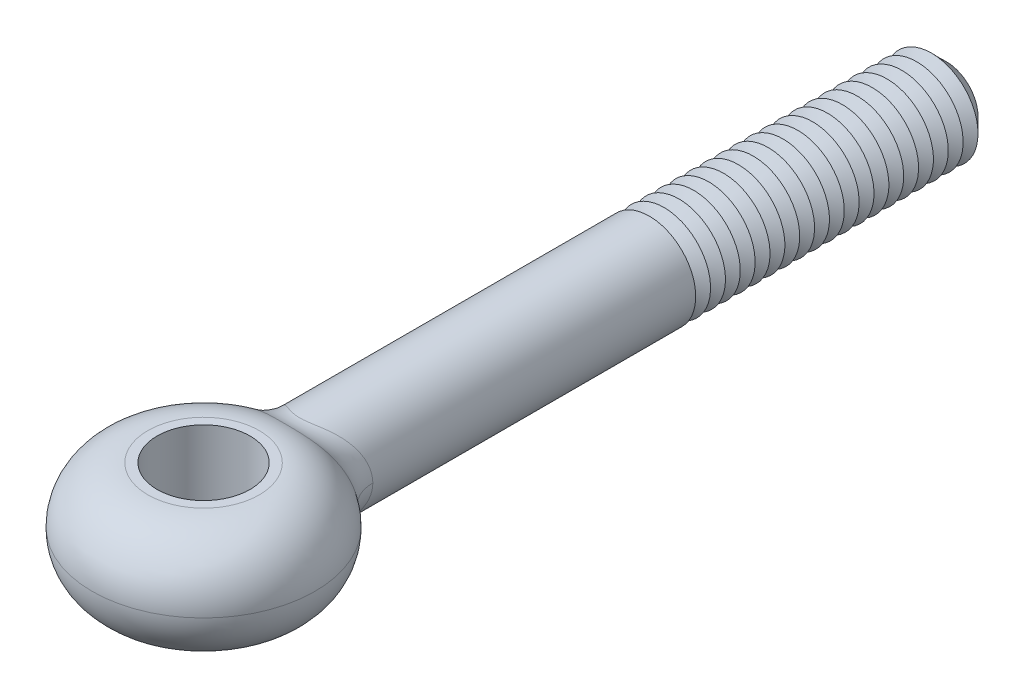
ISO-10303-21;
HEADER;
FILE_DESCRIPTION(('STEP AP214'),'2;1');
FILE_NAME('part.step','',(''),(''),'','','');
FILE_SCHEMA(('AUTOMOTIVE_DESIGN { 1 0 10303 214 1 1 1 1 }'));
ENDSEC;
DATA;
#1=APPLICATION_CONTEXT('core data for automotive mechanical design processes');
#2=APPLICATION_PROTOCOL_DEFINITION('international standard','automotive_design',2000,#1);
#3=PRODUCT_CONTEXT('',#1,'mechanical');
#4=PRODUCT('Part','Part','',(#3));
#5=PRODUCT_RELATED_PRODUCT_CATEGORY('part','',(#4));
#6=PRODUCT_DEFINITION_FORMATION('','',#4);
#7=PRODUCT_DEFINITION_CONTEXT('part definition',#1,'design');
#8=PRODUCT_DEFINITION('design','',#6,#7);
#9=PRODUCT_DEFINITION_SHAPE('','',#8);
#10=(LENGTH_UNIT() NAMED_UNIT(*) SI_UNIT(.MILLI.,.METRE.));
#11=(NAMED_UNIT(*) PLANE_ANGLE_UNIT() SI_UNIT($,.RADIAN.));
#12=(NAMED_UNIT(*) SI_UNIT($,.STERADIAN.) SOLID_ANGLE_UNIT());
#13=UNCERTAINTY_MEASURE_WITH_UNIT(LENGTH_MEASURE(1.E-05),#10,'distance_accuracy_value','');
#14=(GEOMETRIC_REPRESENTATION_CONTEXT(3) GLOBAL_UNCERTAINTY_ASSIGNED_CONTEXT((#13)) GLOBAL_UNIT_ASSIGNED_CONTEXT((#10,
#11,#12)) REPRESENTATION_CONTEXT('',''));
#15=CARTESIAN_POINT('',(0.,0.,0.));
#16=DIRECTION('',(0.,0.,1.));
#17=DIRECTION('',(1.,0.,0.));
#18=AXIS2_PLACEMENT_3D('',#15,#16,#17);
#19=CARTESIAN_POINT('',(0.,0.,-40.));
#20=DIRECTION('',(0.,0.,1.));
#21=DIRECTION('',(1.,0.,0.));
#22=AXIS2_PLACEMENT_3D('',#19,#20,#21);
#23=CYLINDRICAL_SURFACE('',#22,2.5);
#24=CARTESIAN_POINT('',(0.,0.,-24.));
#25=DIRECTION('',(0.,0.,-1.));
#26=DIRECTION('',(-1.,0.,0.));
#27=AXIS2_PLACEMENT_3D('',#24,#25,#26);
#28=CIRCLE('',#27,2.5);
#29=CARTESIAN_POINT('',(-2.5,0.,-24.));
#30=VERTEX_POINT('',#29);
#31=EDGE_CURVE('E79',#30,#30,#28,.T.);
#32=ORIENTED_EDGE('',*,*,#31,.F.);
#33=EDGE_LOOP('',(#32));
#34=FACE_BOUND('',#33,.T.);
#35=CARTESIAN_POINT('',(2.78341953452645,-1.59186120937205,-4.79327924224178));
#36=CARTESIAN_POINT('',(2.14571805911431,-1.30072530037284,-5.3743447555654));
#37=CARTESIAN_POINT('',(2.01927820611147,-1.47394556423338,-6.25925612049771));
#38=CARTESIAN_POINT('',(2.831703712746,-1.53469920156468,-4.80662089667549));
#39=CARTESIAN_POINT('',(2.1772769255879,-1.24792172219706,-5.3898625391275));
#40=CARTESIAN_POINT('',(2.05791099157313,-1.42101777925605,-6.2878456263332));
#41=CARTESIAN_POINT('',(2.87731821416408,-1.47574824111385,-4.81931887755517));
#42=CARTESIAN_POINT('',(2.20644442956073,-1.19462176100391,-5.40436026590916));
#43=CARTESIAN_POINT('',(2.09456285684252,-1.36643355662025,-6.31497994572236));
#44=CARTESIAN_POINT('',(2.96300366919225,-1.35453728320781,-4.8433013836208));
#45=CARTESIAN_POINT('',(2.26036740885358,-1.08700563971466,-5.43139492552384));
#46=CARTESIAN_POINT('',(2.16363788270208,-1.25420118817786,-6.36611531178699));
#47=CARTESIAN_POINT('',(3.00307308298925,-1.29227637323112,-4.85458551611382));
#48=CARTESIAN_POINT('',(2.28509247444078,-1.0327073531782,-5.44391770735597));
#49=CARTESIAN_POINT('',(2.19605986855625,-1.19655219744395,-6.39011548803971));
#50=CARTESIAN_POINT('',(3.11457798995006,-1.10105207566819,-4.88610560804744));
#51=CARTESIAN_POINT('',(2.35298983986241,-0.868493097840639,-5.47855834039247));
#52=CARTESIAN_POINT('',(2.28651645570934,-1.0194926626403,-6.45703286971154));
#53=CARTESIAN_POINT('',(3.17736416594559,-0.967583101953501,-4.90402434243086));
#54=CARTESIAN_POINT('',(2.38951585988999,-0.757939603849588,-5.49756398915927));
#55=CARTESIAN_POINT('',(2.33778513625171,-0.895910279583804,-6.49489913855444));
#56=CARTESIAN_POINT('',(3.2762931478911,-0.696845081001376,-4.93234966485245));
#57=CARTESIAN_POINT('',(2.44601304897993,-0.539370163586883,-5.52722187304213));
#58=CARTESIAN_POINT('',(2.41878010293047,-0.64522692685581,-6.55463771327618));
#59=CARTESIAN_POINT('',(3.31322228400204,-0.559833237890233,-4.94297774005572));
#60=CARTESIAN_POINT('',(2.46634024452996,-0.431613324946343,-5.53805203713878));
#61=CARTESIAN_POINT('',(2.44914166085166,-0.518364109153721,-6.57698187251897));
#62=CARTESIAN_POINT('',(3.36256644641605,-0.281879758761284,-4.95719210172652));
#63=CARTESIAN_POINT('',(2.49336316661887,-0.215769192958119,-5.55249569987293));
#64=CARTESIAN_POINT('',(2.48974403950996,-0.260999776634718,-6.60684652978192));
#65=CARTESIAN_POINT('',(3.37499961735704,-0.140941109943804,-4.96078360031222));
#66=CARTESIAN_POINT('',(2.49999900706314,-0.107956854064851,-5.55607731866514));
#67=CARTESIAN_POINT('',(2.49999975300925,-0.130501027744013,-6.61437799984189));
#68=CARTESIAN_POINT('',(3.37500038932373,0.143401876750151,-4.96078381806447));
#69=CARTESIAN_POINT('',(2.50000101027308,0.109841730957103,-5.55607819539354));
#70=CARTESIAN_POINT('',(2.50000025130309,0.132779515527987,-6.61437856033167));
#71=CARTESIAN_POINT('',(3.36213005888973,0.286806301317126,-4.9570660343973));
#72=CARTESIAN_POINT('',(2.49313362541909,0.21953405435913,-5.55237139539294));
#73=CARTESIAN_POINT('',(2.48938379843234,0.265561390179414,-6.60658237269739));
#74=CARTESIAN_POINT('',(3.31105376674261,0.569447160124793,-4.94235345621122));
#75=CARTESIAN_POINT('',(2.4651455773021,0.439127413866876,-5.53741516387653));
#76=CARTESIAN_POINT('',(2.44735853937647,0.527265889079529,-6.57566949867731));
#77=CARTESIAN_POINT('',(3.2728375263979,0.708681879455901,-4.93135570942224));
#78=CARTESIAN_POINT('',(2.44409422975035,0.548739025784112,-5.52620260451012));
#79=CARTESIAN_POINT('',(2.41594129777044,0.656186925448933,-6.55254659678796));
#80=CARTESIAN_POINT('',(3.17230532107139,0.978796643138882,-4.90258103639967));
#81=CARTESIAN_POINT('',(2.3865722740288,0.767190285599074,-5.4960319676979));
#82=CARTESIAN_POINT('',(2.33365404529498,0.906293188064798,-6.49184951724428));
#83=CARTESIAN_POINT('',(3.11002745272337,1.10968951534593,-4.88481482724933));
#84=CARTESIAN_POINT('',(2.35027184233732,0.875780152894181,-5.47716086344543));
#85=CARTESIAN_POINT('',(2.28281478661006,1.02749029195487,-6.45429818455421));
#86=CARTESIAN_POINT('',(2.96306047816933,1.36001779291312,-4.84327946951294));
#87=CARTESIAN_POINT('',(2.26083780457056,1.09062442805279,-5.43155444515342));
#88=CARTESIAN_POINT('',(2.163610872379,1.25927573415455,-6.36610676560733));
#89=CARTESIAN_POINT('',(2.87837355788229,1.47945431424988,-4.81951090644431));
#90=CARTESIAN_POINT('',(2.20790880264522,1.19669657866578,-5.40491826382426));
#91=CARTESIAN_POINT('',(2.0952479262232,1.36986510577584,-6.31546795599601));
#92=CARTESIAN_POINT('',(2.68558517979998,1.7076778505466,-4.76625186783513));
#93=CARTESIAN_POINT('',(2.08220250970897,1.40697007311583,-5.34311996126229));
#94=CARTESIAN_POINT('',(1.94100402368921,1.58118319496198,-6.20133915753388));
#95=CARTESIAN_POINT('',(2.57685139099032,1.8160319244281,-4.73660969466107));
#96=CARTESIAN_POINT('',(2.00910730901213,1.51094837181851,-5.30782806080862));
#97=CARTESIAN_POINT('',(1.85465458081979,1.68151104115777,-6.13750593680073));
#98=CARTESIAN_POINT('',(2.33928032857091,2.01584554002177,-4.67361867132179));
#99=CARTESIAN_POINT('',(1.84304754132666,1.71007551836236,-5.23013197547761));
#100=CARTESIAN_POINT('',(1.66833418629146,1.86652364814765,-6.00086530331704));
#101=CARTESIAN_POINT('',(2.21043096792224,2.10729485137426,-4.64026759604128));
#102=CARTESIAN_POINT('',(1.75031966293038,1.8052391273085,-5.18781856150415));
#103=CARTESIAN_POINT('',(1.56835504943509,1.95119893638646,-5.92805250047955));
#104=CARTESIAN_POINT('',(1.99751216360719,2.23394098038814,-4.58780602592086));
#105=CARTESIAN_POINT('',(1.59194994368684,1.94203878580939,-5.11897301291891));
#106=CARTESIAN_POINT('',(1.4058468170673,2.06846387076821,-5.81257645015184));
#107=CARTESIAN_POINT('',(1.92009823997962,2.2756671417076,-4.56919966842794));
#108=CARTESIAN_POINT('',(1.5336987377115,1.98802800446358,-5.09422592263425));
#109=CARTESIAN_POINT('',(1.34723871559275,2.10709920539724,-5.77144648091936));
#110=CARTESIAN_POINT('',(1.75973784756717,2.35363226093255,-4.53203912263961));
#111=CARTESIAN_POINT('',(1.41145270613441,2.0755845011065,-5.04404873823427));
#112=CARTESIAN_POINT('',(1.22703303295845,2.17928913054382,-5.68893121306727));
#113=CARTESIAN_POINT('',(1.6767929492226,2.38987276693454,-4.51348492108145));
#114=CARTESIAN_POINT('',(1.3474791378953,2.11718338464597,-5.01861818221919));
#115=CARTESIAN_POINT('',(1.16543630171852,2.21284515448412,-5.6475459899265));
#116=CARTESIAN_POINT('',(1.5051830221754,2.45675134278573,-4.47701205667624));
#117=CARTESIAN_POINT('',(1.21372799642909,2.19531106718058,-4.96793801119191));
#118=CARTESIAN_POINT('',(1.03940209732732,2.27476976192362,-5.5658219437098));
#119=CARTESIAN_POINT('',(1.41651302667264,2.48738445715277,-4.45909396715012));
#120=CARTESIAN_POINT('',(1.14395137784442,2.23187357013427,-4.94267911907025));
#121=CARTESIAN_POINT('',(0.974962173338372,2.30313375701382,-5.52548407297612));
#122=CARTESIAN_POINT('',(1.2334267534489,2.54282715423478,-4.4247261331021));
#123=CARTESIAN_POINT('',(0.998757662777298,2.29910433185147,-4.89365860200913));
#124=CARTESIAN_POINT('',(0.843479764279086,2.35446958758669,-5.44777655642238));
#125=CARTESIAN_POINT('',(1.13901258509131,2.56763885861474,-4.40827585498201));
#126=CARTESIAN_POINT('',(0.923330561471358,2.32981830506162,-4.86987717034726));
#127=CARTESIAN_POINT('',(0.77643823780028,2.37744338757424,-5.41040583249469));
#128=CARTESIAN_POINT('',(0.906301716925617,2.6196969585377,-4.37198138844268));
#129=CARTESIAN_POINT('',(0.736578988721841,2.39507218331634,-4.81694956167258));
#130=CARTESIAN_POINT('',(0.613199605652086,2.42564533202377,-5.32763271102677));
#131=CARTESIAN_POINT('',(0.765194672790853,2.6441512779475,-4.35329767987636));
#132=CARTESIAN_POINT('',(0.622406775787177,2.42664265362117,-4.78918338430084));
#133=CARTESIAN_POINT('',(0.515784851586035,2.44828822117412,-5.28474181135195));
#134=CARTESIAN_POINT('',(0.546606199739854,2.67131287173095,-4.33168473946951));
#135=CARTESIAN_POINT('',(0.444918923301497,2.46206701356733,-4.756847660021));
#136=CARTESIAN_POINT('',(0.366917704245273,2.47343784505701,-5.23496757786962));
#137=CARTESIAN_POINT('',(0.472728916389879,2.67877512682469,-4.3255545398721));
#138=CARTESIAN_POINT('',(0.384868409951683,2.47188464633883,-4.74762646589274));
#139=CARTESIAN_POINT('',(0.316930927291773,2.4803473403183,-5.22081573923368));
#140=CARTESIAN_POINT('',(0.323225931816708,2.69043587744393,-4.31584469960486));
#141=CARTESIAN_POINT('',(0.263268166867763,2.48727604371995,-4.7329952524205));
#142=CARTESIAN_POINT('',(0.21623936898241,2.49114433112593,-5.19837742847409));
#143=CARTESIAN_POINT('',(0.24760125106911,2.69463623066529,-4.31226360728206));
#144=CARTESIAN_POINT('',(0.201683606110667,2.49286186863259,-4.72757415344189));
#145=CARTESIAN_POINT('',(0.165535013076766,2.49503354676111,-5.19008761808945));
#146=CARTESIAN_POINT('',(0.094861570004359,2.69970310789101,-4.30793149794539));
#147=CARTESIAN_POINT('',(0.0772955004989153,2.49960079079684,-4.72101731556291));
#148=CARTESIAN_POINT('',(0.0633454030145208,2.49972510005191,-5.18005710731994));
#149=CARTESIAN_POINT('',(0.017739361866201,2.70054092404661,-4.30720485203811));
#150=CARTESIAN_POINT('',(0.0144434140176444,2.50072036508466,-4.71991397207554));
#151=CARTESIAN_POINT('',(0.0118571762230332,2.500500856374,-5.17837280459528));
#152=CARTESIAN_POINT('',(-0.136203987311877,2.69878264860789,-4.30871632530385));
#153=CARTESIAN_POINT('',(-0.110955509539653,2.49837825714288,-4.72220376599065));
#154=CARTESIAN_POINT('',(-0.0909950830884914,2.49887282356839,-5.18187386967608));
#155=CARTESIAN_POINT('',(-0.213025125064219,2.69618651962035,-4.31095447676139));
#156=CARTESIAN_POINT('',(-0.173546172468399,2.49491488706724,-4.72559855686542));
#157=CARTESIAN_POINT('',(-0.142359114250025,2.49646899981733,-5.18705931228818));
#158=CARTESIAN_POINT('',(-0.36553597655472,2.68761038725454,-4.31820554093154));
#159=CARTESIAN_POINT('',(-0.297684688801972,2.48354513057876,-4.73655288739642));
#160=CARTESIAN_POINT('',(-0.244685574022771,2.48852813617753,-5.20383450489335));
#161=CARTESIAN_POINT('',(-0.441220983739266,2.6816189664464,-4.32322781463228));
#162=CARTESIAN_POINT('',(-0.359268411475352,2.47561613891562,-4.74413371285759));
#163=CARTESIAN_POINT('',(-0.295646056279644,2.48298052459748,-5.21544586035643));
#164=CARTESIAN_POINT('',(-0.590415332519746,2.6663656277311,-4.33565461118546));
#165=CARTESIAN_POINT('',(-0.480475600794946,2.4556075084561,-4.76278791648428));
#166=CARTESIAN_POINT('',(-0.396672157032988,2.46885706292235,-5.24411576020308));
#167=CARTESIAN_POINT('',(-0.663923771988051,2.65710237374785,-4.34306010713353));
#168=CARTESIAN_POINT('',(-0.540131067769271,2.44351406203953,-4.77387344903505));
#169=CARTESIAN_POINT('',(-0.44673740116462,2.46027997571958,-5.26117652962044));
#170=CARTESIAN_POINT('',(-0.831352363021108,2.63198098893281,-4.36244332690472));
#171=CARTESIAN_POINT('',(-0.675735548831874,2.41105829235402,-4.80270108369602));
#172=CARTESIAN_POINT('',(-0.561587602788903,2.43701943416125,-5.30571455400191));
#173=CARTESIAN_POINT('',(-0.924289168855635,2.6149613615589,-4.37512591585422));
#174=CARTESIAN_POINT('',(-0.750790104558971,2.38927243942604,-4.82144973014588));
#175=CARTESIAN_POINT('',(-0.625964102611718,2.42126052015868,-5.33477828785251));
#176=CARTESIAN_POINT('',(-1.10516352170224,2.57574008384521,-4.40274397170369));
#177=CARTESIAN_POINT('',(-0.89617727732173,2.33992937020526,-4.86182815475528));
#178=CARTESIAN_POINT('',(-0.752583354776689,2.38494452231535,-5.39780912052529));
#179=CARTESIAN_POINT('',(-1.19309918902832,2.55353650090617,-4.41768027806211));
#180=CARTESIAN_POINT('',(-0.966539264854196,2.31233373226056,-4.88348226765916));
#181=CARTESIAN_POINT('',(-0.814825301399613,2.36438564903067,-5.43177804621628));
#182=CARTESIAN_POINT('',(-1.36408592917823,2.50411967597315,-4.44895154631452));
#183=CARTESIAN_POINT('',(-1.10247087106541,2.25205127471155,-4.92826951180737));
#184=CARTESIAN_POINT('',(-0.937136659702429,2.31862932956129,-5.50258991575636));
#185=CARTESIAN_POINT('',(-1.4471314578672,2.47690088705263,-4.46528804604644));
#186=CARTESIAN_POINT('',(-1.16804717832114,2.21932398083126,-4.95142074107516));
#187=CARTESIAN_POINT('',(-0.997203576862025,2.29342674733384,-5.53943601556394));
#188=CARTESIAN_POINT('',(-1.60835015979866,2.41761835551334,-4.49866880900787));
#189=CARTESIAN_POINT('',(-1.29428986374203,2.14941948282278,-4.99811371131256));
#190=CARTESIAN_POINT('',(-1.11497966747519,2.23853551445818,-5.61439808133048));
#191=CARTESIAN_POINT('',(-1.68652398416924,2.38555526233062,-4.51571297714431));
#192=CARTESIAN_POINT('',(-1.3549551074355,2.11221158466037,-5.02166467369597));
#193=CARTESIAN_POINT('',(-1.17268915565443,2.20884746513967,-5.65251387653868));
#194=CARTESIAN_POINT('',(-1.84102679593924,2.31537342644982,-4.55065121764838));
#195=CARTESIAN_POINT('',(-1.47363936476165,2.03237790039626,-5.06928809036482));
#196=CARTESIAN_POINT('',(-1.28777958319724,2.1438642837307,-5.73031643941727));
#197=CARTESIAN_POINT('',(-1.91717041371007,2.27706976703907,-4.56855283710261));
#198=CARTESIAN_POINT('',(-1.5314431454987,1.98957796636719,-5.09334433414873));
#199=CARTESIAN_POINT('',(-1.34506326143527,2.10839793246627,-5.77000745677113));
#200=CARTESIAN_POINT('',(-2.06435914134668,2.19549414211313,-4.60411592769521));
#201=CARTESIAN_POINT('',(-1.64179513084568,1.90033354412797,-5.14043913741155));
#202=CARTESIAN_POINT('',(-1.45671149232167,2.03286494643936,-5.84853073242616));
#203=CARTESIAN_POINT('',(-2.13540269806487,2.15222067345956,-4.62177732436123));
#204=CARTESIAN_POINT('',(-1.69431856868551,1.85386594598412,-5.16347382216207));
#205=CARTESIAN_POINT('',(-1.51107515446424,1.99279691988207,-5.88736272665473));
#206=CARTESIAN_POINT('',(-2.34062893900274,2.01525525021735,-4.67380595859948));
#207=CARTESIAN_POINT('',(-1.84426716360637,1.70956328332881,-5.23047721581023));
#208=CARTESIAN_POINT('',(-1.66923732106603,1.86597708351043,-6.00131438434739));
#209=CARTESIAN_POINT('',(-2.46717911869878,1.91429396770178,-4.70728175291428));
#210=CARTESIAN_POINT('',(-1.93332878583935,1.60734351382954,-5.27203498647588));
#211=CARTESIAN_POINT('',(-1.76831121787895,1.7724944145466,-6.07403221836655));
#212=CARTESIAN_POINT('',(-2.70679041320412,1.68661240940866,-4.77193962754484));
#213=CARTESIAN_POINT('',(-2.09686028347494,1.38674049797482,-5.35007469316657));
#214=CARTESIAN_POINT('',(-1.95773190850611,1.56167815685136,-6.21363092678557));
#215=CARTESIAN_POINT('',(-2.81813452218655,1.55853025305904,-4.80276284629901));
#216=CARTESIAN_POINT('',(-2.16933176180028,1.26784061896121,-5.38577211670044));
#217=CARTESIAN_POINT('',(-2.04687161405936,1.44308356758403,-6.27966835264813));
#218=CARTESIAN_POINT('',(-3.01261219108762,1.28525500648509,-4.85717783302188));
#219=CARTESIAN_POINT('',(-2.29190513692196,1.02488048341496,-5.44718873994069));
#220=CARTESIAN_POINT('',(-2.20361102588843,1.19005093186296,-6.39571302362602));
#221=CARTESIAN_POINT('',(-3.09572994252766,1.14005238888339,-4.8807655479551));
#222=CARTESIAN_POINT('',(-2.34165620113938,0.901027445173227,-5.47274428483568));
#223=CARTESIAN_POINT('',(-2.27119866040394,1.05560406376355,-6.44571128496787));
#224=CARTESIAN_POINT('',(-3.22543031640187,0.849553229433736,-4.91775305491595));
#225=CARTESIAN_POINT('',(-2.41740189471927,0.661472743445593,-5.51211129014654));
#226=CARTESIAN_POINT('',(-2.37706331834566,0.786623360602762,-6.5238938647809));
#227=CARTESIAN_POINT('',(-3.27441877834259,0.705208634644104,-4.93182105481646));
#228=CARTESIAN_POINT('',(-2.44479989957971,0.546140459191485,-5.52660885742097));
#229=CARTESIAN_POINT('',(-2.41726455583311,0.652970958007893,-6.55351221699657));
#230=CARTESIAN_POINT('',(-3.3444386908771,0.410725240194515,-4.95196114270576));
#231=CARTESIAN_POINT('',(-2.48358904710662,0.315091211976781,-5.54724099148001));
#232=CARTESIAN_POINT('',(-2.47480549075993,0.380301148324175,-6.59586878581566));
#233=CARTESIAN_POINT('',(-3.365557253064,0.260606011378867,-4.95805814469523));
#234=CARTESIAN_POINT('',(-2.49491680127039,0.199701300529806,-5.55334192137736));
#235=CARTESIAN_POINT('',(-2.49221642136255,0.241301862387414,-6.6086595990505));
#236=CARTESIAN_POINT('',(-3.3741611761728,0.0734663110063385,-4.96054177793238));
#237=CARTESIAN_POINT('',(-2.49954473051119,0.0562665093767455,-5.55583336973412));
#238=CARTESIAN_POINT('',(-2.49930902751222,0.06802436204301,-6.61387040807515));
#239=CARTESIAN_POINT('',(-3.37500321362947,0.0367413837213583,-4.9607847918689));
#240=CARTESIAN_POINT('',(-2.49999869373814,0.0281412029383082,-5.55607760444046));
#241=CARTESIAN_POINT('',(-2.50000304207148,0.0340197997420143,-6.61438032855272));
#242=CARTESIAN_POINT('',(-3.37498749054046,-0.143020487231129,-4.9607794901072));
#243=CARTESIAN_POINT('',(-2.50000508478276,-0.109543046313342,-5.55607833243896));
#244=CARTESIAN_POINT('',(-2.49998815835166,-0.132426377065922,-6.61437029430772));
#245=CARTESIAN_POINT('',(-3.36216727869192,-0.286290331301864,-4.9570765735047));
#246=CARTESIAN_POINT('',(-2.49315564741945,-0.219138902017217,-5.55238275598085));
#247=CARTESIAN_POINT('',(-2.48941413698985,-0.265083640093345,-6.60660464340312));
#248=CARTESIAN_POINT('',(-3.31118832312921,-0.5690125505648,-4.94239239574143));
#249=CARTESIAN_POINT('',(-2.46521750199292,-0.438784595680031,-5.53745400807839));
#250=CARTESIAN_POINT('',(-2.44746953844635,-0.526863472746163,-6.57575118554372));
#251=CARTESIAN_POINT('',(-3.2729343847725,-0.708448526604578,-4.93138379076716));
#252=CARTESIAN_POINT('',(-2.44415038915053,-0.548545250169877,-5.5262324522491));
#253=CARTESIAN_POINT('',(-2.41602083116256,-0.65597085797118,-6.55260581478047));
#254=CARTESIAN_POINT('',(-3.172210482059,-0.979024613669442,-4.90255353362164));
#255=CARTESIAN_POINT('',(-2.38651784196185,-0.767377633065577,-5.49600302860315));
#256=CARTESIAN_POINT('',(-2.3335761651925,-0.906504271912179,-6.49179151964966));
#257=CARTESIAN_POINT('',(-3.10977969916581,-1.11017775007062,-4.88474290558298));
#258=CARTESIAN_POINT('',(-2.35012430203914,-0.876197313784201,-5.47708301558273));
#259=CARTESIAN_POINT('',(-2.28261183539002,-1.0279423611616,-6.45414609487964));
#260=CARTESIAN_POINT('',(-2.99946679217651,-1.29797370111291,-4.85356946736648));
#261=CARTESIAN_POINT('',(-2.28287045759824,-1.0376648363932,-5.44279118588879));
#262=CARTESIAN_POINT('',(-2.19314078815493,-1.2018275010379,-6.3879550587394));
#263=CARTESIAN_POINT('',(-2.95997615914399,-1.35901454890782,-4.84245162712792));
#264=CARTESIAN_POINT('',(-2.25847709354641,-1.0909506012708,-5.43044281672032));
#265=CARTESIAN_POINT('',(-2.16119309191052,-1.25834680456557,-6.36430554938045));
#266=CARTESIAN_POINT('',(-2.87565347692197,-1.4778979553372,-4.81885538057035));
#267=CARTESIAN_POINT('',(-2.20537734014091,-1.19657026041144,-5.40382980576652));
#268=CARTESIAN_POINT('',(-2.09322519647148,-1.36842403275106,-6.31398947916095));
#269=CARTESIAN_POINT('',(-2.83082295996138,-1.53574142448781,-4.8063773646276));
#270=CARTESIAN_POINT('',(-2.17669982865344,-1.24888735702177,-5.38957859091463));
#271=CARTESIAN_POINT('',(-2.05720616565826,-1.42198280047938,-6.2873237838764));
#272=CARTESIAN_POINT('',(-2.78341953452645,-1.59186120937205,-4.79327924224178));
#273=CARTESIAN_POINT('',(-2.14571805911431,-1.30072530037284,-5.3743447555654));
#274=CARTESIAN_POINT('',(-2.01927820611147,-1.47394556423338,-6.25925612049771));
#275=(BOUNDED_SURFACE() B_SPLINE_SURFACE(3,2,((#35,#36,#37),(#38,#39,#40),(#41,#42,#43),(#44,
#45,#46),(#47,#48,#49),(#50,#51,#52),(#53,#54,#55),(#56,#57,#58),(#59,#60,#61),(#62,#63,#64),
(#65,#66,#67),(#68,#69,#70),(#71,#72,#73),(#74,#75,#76),(#77,#78,#79),(#80,#81,#82),(#83,#84,
#85),(#86,#87,#88),(#89,#90,#91),(#92,#93,#94),(#95,#96,#97),(#98,#99,#100),(#101,#102,#103),
(#104,#105,#106),(#107,#108,#109),(#110,#111,#112),(#113,#114,#115),(#116,#117,#118),(#119,#120,
#121),(#122,#123,#124),(#125,#126,#127),(#128,#129,#130),(#131,#132,#133),(#134,#135,#136),
(#137,#138,#139),(#140,#141,#142),(#143,#144,#145),(#146,#147,#148),(#149,#150,#151),(#152,#153,
#154),(#155,#156,#157),(#158,#159,#160),(#161,#162,#163),(#164,#165,#166),(#167,#168,#169),
(#170,#171,#172),(#173,#174,#175),(#176,#177,#178),(#179,#180,#181),(#182,#183,#184),(#185,#186,
#187),(#188,#189,#190),(#191,#192,#193),(#194,#195,#196),(#197,#198,#199),(#200,#201,#202),
(#203,#204,#205),(#206,#207,#208),(#209,#210,#211),(#212,#213,#214),(#215,#216,#217),(#218,#219,
#220),(#221,#222,#223),(#224,#225,#226),(#227,#228,#229),(#230,#231,#232),(#233,#234,#235),
(#236,#237,#238),(#239,#240,#241),(#242,#243,#244),(#245,#246,#247),(#248,#249,#250),(#251,#252,
#253),(#254,#255,#256),(#257,#258,#259),(#260,#261,#262),(#263,#264,#265),(#266,#267,#268),
(#269,#270,#271),(#272,#273,#274)),.UNSPECIFIED.,.F.,.F.,.F.) B_SPLINE_SURFACE_WITH_KNOTS((4,2,
2,2,2,2,2,2,2,2,2,2,2,2,2,2,2,2,2,2,2,2,2,2,2,2,2,2,2,2,2,2,2,2,2,2,2,2,2,4),(3,3),(0.,
0.363898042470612,0.727896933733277,1.45549120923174,2.15986563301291,2.86371811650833,
3.57985953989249,4.2962915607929,5.01159387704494,5.72682644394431,6.46375484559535,
7.20112776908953,7.5994115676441,7.99758275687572,8.39610414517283,8.79448006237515,
9.34746095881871,9.62295413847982,9.89829030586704,10.175972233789,10.4536571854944,
10.7322815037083,11.0110197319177,11.3788266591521,11.7467709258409,12.1151246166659,
12.4834289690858,12.8658412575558,13.2483695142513,14.0121043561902,14.8329658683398,
15.6542863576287,16.4093703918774,17.1620886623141,17.3457541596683,18.060695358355,
18.7783276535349,19.4948017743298,19.8521704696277,20.2094368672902),(0.,1.),
.UNSPECIFIED.) GEOMETRIC_REPRESENTATION_ITEM() RATIONAL_B_SPLINE_SURFACE(((1.,0.91012003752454,
1.),(1.,0.908112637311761,1.),(1.,0.906182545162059,1.),(1.,0.902507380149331,1.),(1.,
0.900762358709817,1.),(1.,0.895853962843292,1.),(1.,0.8930149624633,1.),(1.,0.888491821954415,
1.),(1.,0.886773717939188,1.),(1.,0.884469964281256,1.),(1.,0.883883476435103,1.),(1.,
0.883883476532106,1.),(1.,0.884490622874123,1.),(1.,0.886874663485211,1.),(1.,0.888652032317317,
1.),(1.,0.893243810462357,1.),(1.,0.896056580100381,1.),(1.,0.902521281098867,1.),(1.,
0.906173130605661,1.),(1.,0.914186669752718,1.),(1.,0.918566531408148,1.),(1.,0.927642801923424,
1.),(1.,0.932339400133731,1.),(1.,0.939527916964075,1.),(1.,0.942040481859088,1.),(1.,
0.946983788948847,1.),(1.,0.949414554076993,1.),(1.,0.954120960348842,1.),(1.,0.95639646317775,
1.),(1.,0.960697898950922,1.),(1.,0.962723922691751,1.),(1.,0.967135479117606,1.),(1.,
0.969355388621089,1.),(1.,0.971895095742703,1.),(1.,0.972609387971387,1.),(1.,0.973736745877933,
1.),(1.,0.974149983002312,1.),(1.,0.974649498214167,1.),(1.,0.974732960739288,1.),(1.,
0.974558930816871,1.),(1.,0.974301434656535,1.),(1.,0.973462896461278,1.),(1.,0.972880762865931,
1.),(1.,0.971429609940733,1.),(1.,0.970560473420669,1.),(1.,0.968264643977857,1.),(1.,
0.966748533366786,1.),(1.,0.963399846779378,1.),(1.,0.961567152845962,1.),(1.,0.957673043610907,
1.),(1.,0.955611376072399,1.),(1.,0.951336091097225,1.),(1.,0.949122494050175,1.),(1.,
0.944519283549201,1.),(1.,0.942126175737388,1.),(1.,0.937304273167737,1.),(1.,0.934875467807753,
1.),(1.,0.92762365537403,1.),(1.,0.922826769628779,1.),(1.,0.913355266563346,1.),(1.,
0.908716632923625,1.),(1.,0.900383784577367,1.),(1.,0.896690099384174,1.),(1.,0.890834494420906,
1.),(1.,0.888573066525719,1.),(1.,0.885321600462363,1.),(1.,0.88432760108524,1.),(1.,
0.883922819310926,1.),(1.,0.883883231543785,1.),(1.,0.883884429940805,1.),(1.,0.884488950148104,
1.),(1.,0.886868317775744,1.),(1.,0.88864756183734,1.),(1.,0.893248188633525,1.),(1.,
0.896067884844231,1.),(1.,0.900919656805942,1.),(1.,0.902638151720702,1.),(1.,0.906252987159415,
1.),(1.,0.908149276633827,1.),(1.,0.91012003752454,1.))) REPRESENTATION_ITEM('') SURFACE());
#276=CARTESIAN_POINT('',(-2.01927820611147,-1.47394556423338,-6.25925612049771));
#277=CARTESIAN_POINT('',(-2.05720616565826,-1.42198280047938,-6.2873237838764));
#278=CARTESIAN_POINT('',(-2.09322519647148,-1.36842403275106,-6.31398947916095));
#279=CARTESIAN_POINT('',(-2.16119309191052,-1.25834680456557,-6.36430554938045));
#280=CARTESIAN_POINT('',(-2.19314078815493,-1.2018275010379,-6.3879550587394));
#281=CARTESIAN_POINT('',(-2.28261183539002,-1.0279423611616,-6.45414609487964));
#282=CARTESIAN_POINT('',(-2.3335761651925,-0.906504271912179,-6.49179151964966));
#283=CARTESIAN_POINT('',(-2.41602083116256,-0.655970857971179,-6.55260581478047));
#284=CARTESIAN_POINT('',(-2.44746953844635,-0.526863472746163,-6.57575118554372));
#285=CARTESIAN_POINT('',(-2.48941413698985,-0.265083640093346,-6.60660464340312));
#286=CARTESIAN_POINT('',(-2.49998815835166,-0.132426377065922,-6.61437029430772));
#287=CARTESIAN_POINT('',(-2.50000304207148,0.0340197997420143,-6.61438032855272));
#288=CARTESIAN_POINT('',(-2.49930902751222,0.0680243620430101,-6.61387040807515));
#289=CARTESIAN_POINT('',(-2.49221642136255,0.241301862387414,-6.6086595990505));
#290=CARTESIAN_POINT('',(-2.47480549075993,0.380301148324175,-6.59586878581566));
#291=CARTESIAN_POINT('',(-2.41726455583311,0.652970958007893,-6.55351221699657));
#292=CARTESIAN_POINT('',(-2.37706331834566,0.786623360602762,-6.5238938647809));
#293=CARTESIAN_POINT('',(-2.27119866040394,1.05560406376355,-6.44571128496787));
#294=CARTESIAN_POINT('',(-2.20361102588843,1.19005093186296,-6.39571302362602));
#295=CARTESIAN_POINT('',(-2.04687161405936,1.44308356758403,-6.27966835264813));
#296=CARTESIAN_POINT('',(-1.95773190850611,1.56167815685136,-6.21363092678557));
#297=CARTESIAN_POINT('',(-1.76831121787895,1.7724944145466,-6.07403221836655));
#298=CARTESIAN_POINT('',(-1.66923732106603,1.86597708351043,-6.00131438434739));
#299=CARTESIAN_POINT('',(-1.51107515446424,1.99279691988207,-5.88736272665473));
#300=CARTESIAN_POINT('',(-1.45671149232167,2.03286494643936,-5.84853073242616));
#301=CARTESIAN_POINT('',(-1.34506326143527,2.10839793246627,-5.77000745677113));
#302=CARTESIAN_POINT('',(-1.28777958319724,2.1438642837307,-5.73031643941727));
#303=CARTESIAN_POINT('',(-1.17268915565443,2.20884746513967,-5.65251387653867));
#304=CARTESIAN_POINT('',(-1.11497966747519,2.23853551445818,-5.61439808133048));
#305=CARTESIAN_POINT('',(-0.997203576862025,2.29342674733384,-5.53943601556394));
#306=CARTESIAN_POINT('',(-0.937136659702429,2.31862932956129,-5.50258991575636));
#307=CARTESIAN_POINT('',(-0.814825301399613,2.36438564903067,-5.43177804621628));
#308=CARTESIAN_POINT('',(-0.752583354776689,2.38494452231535,-5.39780912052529));
#309=CARTESIAN_POINT('',(-0.625964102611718,2.42126052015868,-5.33477828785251));
#310=CARTESIAN_POINT('',(-0.561587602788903,2.43701943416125,-5.30571455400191));
#311=CARTESIAN_POINT('',(-0.44673740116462,2.46027997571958,-5.26117652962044));
#312=CARTESIAN_POINT('',(-0.396672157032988,2.46885706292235,-5.24411576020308));
#313=CARTESIAN_POINT('',(-0.295646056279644,2.48298052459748,-5.21544586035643));
#314=CARTESIAN_POINT('',(-0.244685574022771,2.48852813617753,-5.20383450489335));
#315=CARTESIAN_POINT('',(-0.142359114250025,2.49646899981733,-5.18705931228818));
#316=CARTESIAN_POINT('',(-0.0909950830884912,2.49887282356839,-5.18187386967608));
#317=CARTESIAN_POINT('',(0.0118571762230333,2.500500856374,-5.17837280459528));
#318=CARTESIAN_POINT('',(0.0633454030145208,2.49972510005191,-5.18005710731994));
#319=CARTESIAN_POINT('',(0.165535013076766,2.49503354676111,-5.19008761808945));
#320=CARTESIAN_POINT('',(0.21623936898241,2.49114433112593,-5.19837742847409));
#321=CARTESIAN_POINT('',(0.316930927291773,2.4803473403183,-5.22081573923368));
#322=CARTESIAN_POINT('',(0.366917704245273,2.47343784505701,-5.23496757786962));
#323=CARTESIAN_POINT('',(0.515784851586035,2.44828822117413,-5.28474181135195));
#324=CARTESIAN_POINT('',(0.613199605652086,2.42564533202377,-5.32763271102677));
#325=CARTESIAN_POINT('',(0.77643823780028,2.37744338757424,-5.41040583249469));
#326=CARTESIAN_POINT('',(0.843479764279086,2.35446958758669,-5.44777655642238));
#327=CARTESIAN_POINT('',(0.974962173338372,2.30313375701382,-5.52548407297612));
#328=CARTESIAN_POINT('',(1.03940209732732,2.27476976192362,-5.5658219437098));
#329=CARTESIAN_POINT('',(1.16543630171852,2.21284515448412,-5.6475459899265));
#330=CARTESIAN_POINT('',(1.22703303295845,2.17928913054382,-5.68893121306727));
#331=CARTESIAN_POINT('',(1.34723871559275,2.10709920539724,-5.77144648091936));
#332=CARTESIAN_POINT('',(1.4058468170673,2.06846387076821,-5.81257645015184));
#333=CARTESIAN_POINT('',(1.56835504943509,1.95119893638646,-5.92805250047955));
#334=CARTESIAN_POINT('',(1.66833418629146,1.86652364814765,-6.00086530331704));
#335=CARTESIAN_POINT('',(1.85465458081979,1.68151104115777,-6.13750593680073));
#336=CARTESIAN_POINT('',(1.94100402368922,1.58118319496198,-6.20133915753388));
#337=CARTESIAN_POINT('',(2.0952479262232,1.36986510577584,-6.31546795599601));
#338=CARTESIAN_POINT('',(2.163610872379,1.25927573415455,-6.36610676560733));
#339=CARTESIAN_POINT('',(2.28281478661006,1.02749029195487,-6.45429818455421));
#340=CARTESIAN_POINT('',(2.33365404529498,0.906293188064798,-6.49184951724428));
#341=CARTESIAN_POINT('',(2.41594129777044,0.656186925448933,-6.55254659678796));
#342=CARTESIAN_POINT('',(2.44735853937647,0.52726588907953,-6.57566949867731));
#343=CARTESIAN_POINT('',(2.48938379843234,0.265561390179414,-6.60658237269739));
#344=CARTESIAN_POINT('',(2.50000025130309,0.132779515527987,-6.61437856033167));
#345=CARTESIAN_POINT('',(2.49999975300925,-0.130501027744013,-6.61437799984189));
#346=CARTESIAN_POINT('',(2.48974403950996,-0.260999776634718,-6.60684652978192));
#347=CARTESIAN_POINT('',(2.44914166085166,-0.518364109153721,-6.57698187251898));
#348=CARTESIAN_POINT('',(2.41878010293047,-0.64522692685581,-6.55463771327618));
#349=CARTESIAN_POINT('',(2.33778513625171,-0.895910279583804,-6.49489913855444));
#350=CARTESIAN_POINT('',(2.28651645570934,-1.0194926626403,-6.45703286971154));
#351=CARTESIAN_POINT('',(2.19605986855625,-1.19655219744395,-6.39011548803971));
#352=CARTESIAN_POINT('',(2.16363788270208,-1.25420118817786,-6.36611531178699));
#353=CARTESIAN_POINT('',(2.09456285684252,-1.36643355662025,-6.31497994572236));
#354=CARTESIAN_POINT('',(2.05791099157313,-1.42101777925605,-6.2878456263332));
#355=CARTESIAN_POINT('',(2.01927820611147,-1.47394556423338,-6.25925612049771));
#356=B_SPLINE_CURVE_WITH_KNOTS('',3,(#276,#277,#278,#279,#280,#281,#282,#283,#284,#285,#286,
#287,#288,#289,#290,#291,#292,#293,#294,#295,#296,#297,#298,#299,#300,#301,#302,#303,#304,#305,
#306,#307,#308,#309,#310,#311,#312,#313,#314,#315,#316,#317,#318,#319,#320,#321,#322,#323,#324,
#325,#326,#327,#328,#329,#330,#331,#332,#333,#334,#335,#336,#337,#338,#339,#340,#341,#342,#343,
#344,#345,#346,#347,#348,#349,#350,#351,#352,#353,#354,#355),.UNSPECIFIED.,.F.,.F.,(4,2,2,2,2,2,
2,2,2,2,2,2,2,2,2,2,2,2,2,2,2,2,2,2,2,2,2,2,2,2,2,2,2,2,2,2,2,2,2,4),(0.,0.357266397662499,
0.714635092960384,1.43110921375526,2.14874150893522,2.86368270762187,3.04734820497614,
3.80006647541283,4.55515050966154,5.37647099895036,6.19733251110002,6.96106735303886,
7.34359560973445,7.7260078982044,8.09431225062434,8.46266594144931,8.83061020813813,
9.19841713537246,9.47715536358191,9.75577968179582,10.0334646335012,10.3111465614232,
10.5864827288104,10.8619759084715,11.4149568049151,11.8133327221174,12.2118541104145,
12.6100252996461,13.0083090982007,13.7456820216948,14.4826104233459,15.1978429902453,
15.9131453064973,16.6295773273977,17.3457187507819,18.0495712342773,18.7539456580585,
19.4815399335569,19.8455388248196,20.2094368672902),.UNSPECIFIED.);
#357=CARTESIAN_POINT('',(-2.5,0.,-6.61437827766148));
#358=VERTEX_POINT('',#357);
#359=CARTESIAN_POINT('',(2.5,0.,-6.61437827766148));
#360=VERTEX_POINT('',#359);
#361=EDGE_CURVE('E81',#358,#360,#356,.T.);
#362=ORIENTED_EDGE('',*,*,#361,.T.);
#363=CARTESIAN_POINT('',(-2.78341953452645,1.59186120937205,-4.79327924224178));
#364=CARTESIAN_POINT('',(-2.14571805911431,1.30072530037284,-5.3743447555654));
#365=CARTESIAN_POINT('',(-2.01927820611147,1.47394556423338,-6.25925612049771));
#366=CARTESIAN_POINT('',(-2.831703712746,1.53469920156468,-4.80662089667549));
#367=CARTESIAN_POINT('',(-2.1772769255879,1.24792172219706,-5.3898625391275));
#368=CARTESIAN_POINT('',(-2.05791099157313,1.42101777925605,-6.2878456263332));
#369=CARTESIAN_POINT('',(-2.87731821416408,1.47574824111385,-4.81931887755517));
#370=CARTESIAN_POINT('',(-2.20644442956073,1.19462176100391,-5.40436026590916));
#371=CARTESIAN_POINT('',(-2.09456285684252,1.36643355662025,-6.31497994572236));
#372=CARTESIAN_POINT('',(-2.96300366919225,1.35453728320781,-4.8433013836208));
#373=CARTESIAN_POINT('',(-2.26036740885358,1.08700563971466,-5.43139492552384));
#374=CARTESIAN_POINT('',(-2.16363788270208,1.25420118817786,-6.36611531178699));
#375=CARTESIAN_POINT('',(-3.00307308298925,1.29227637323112,-4.85458551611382));
#376=CARTESIAN_POINT('',(-2.28509247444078,1.0327073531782,-5.44391770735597));
#377=CARTESIAN_POINT('',(-2.19605986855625,1.19655219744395,-6.39011548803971));
#378=CARTESIAN_POINT('',(-3.11457798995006,1.10105207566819,-4.88610560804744));
#379=CARTESIAN_POINT('',(-2.35298983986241,0.868493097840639,-5.47855834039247));
#380=CARTESIAN_POINT('',(-2.28651645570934,1.0194926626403,-6.45703286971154));
#381=CARTESIAN_POINT('',(-3.17736416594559,0.967583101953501,-4.90402434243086));
#382=CARTESIAN_POINT('',(-2.38951585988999,0.757939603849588,-5.49756398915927));
#383=CARTESIAN_POINT('',(-2.33778513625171,0.895910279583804,-6.49489913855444));
#384=CARTESIAN_POINT('',(-3.2762931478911,0.696845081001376,-4.93234966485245));
#385=CARTESIAN_POINT('',(-2.44601304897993,0.539370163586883,-5.52722187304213));
#386=CARTESIAN_POINT('',(-2.41878010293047,0.64522692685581,-6.55463771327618));
#387=CARTESIAN_POINT('',(-3.31322228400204,0.559833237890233,-4.94297774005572));
#388=CARTESIAN_POINT('',(-2.46634024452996,0.431613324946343,-5.53805203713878));
#389=CARTESIAN_POINT('',(-2.44914166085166,0.518364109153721,-6.57698187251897));
#390=CARTESIAN_POINT('',(-3.36256644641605,0.281879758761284,-4.95719210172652));
#391=CARTESIAN_POINT('',(-2.49336316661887,0.215769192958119,-5.55249569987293));
#392=CARTESIAN_POINT('',(-2.48974403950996,0.260999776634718,-6.60684652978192));
#393=CARTESIAN_POINT('',(-3.37499961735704,0.140941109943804,-4.96078360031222));
#394=CARTESIAN_POINT('',(-2.49999900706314,0.107956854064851,-5.55607731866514));
#395=CARTESIAN_POINT('',(-2.49999975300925,0.130501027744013,-6.61437799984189));
#396=CARTESIAN_POINT('',(-3.37500038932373,-0.143401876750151,-4.96078381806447));
#397=CARTESIAN_POINT('',(-2.50000101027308,-0.109841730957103,-5.55607819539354));
#398=CARTESIAN_POINT('',(-2.50000025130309,-0.132779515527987,-6.61437856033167));
#399=CARTESIAN_POINT('',(-3.36213005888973,-0.286806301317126,-4.9570660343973));
#400=CARTESIAN_POINT('',(-2.49313362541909,-0.21953405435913,-5.55237139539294));
#401=CARTESIAN_POINT('',(-2.48938379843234,-0.265561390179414,-6.60658237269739));
#402=CARTESIAN_POINT('',(-3.31105376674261,-0.569447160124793,-4.94235345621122));
#403=CARTESIAN_POINT('',(-2.4651455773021,-0.439127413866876,-5.53741516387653));
#404=CARTESIAN_POINT('',(-2.44735853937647,-0.527265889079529,-6.57566949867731));
#405=CARTESIAN_POINT('',(-3.2728375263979,-0.708681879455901,-4.93135570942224));
#406=CARTESIAN_POINT('',(-2.44409422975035,-0.548739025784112,-5.52620260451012));
#407=CARTESIAN_POINT('',(-2.41594129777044,-0.656186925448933,-6.55254659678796));
#408=CARTESIAN_POINT('',(-3.17230532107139,-0.978796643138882,-4.90258103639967));
#409=CARTESIAN_POINT('',(-2.3865722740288,-0.767190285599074,-5.4960319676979));
#410=CARTESIAN_POINT('',(-2.33365404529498,-0.906293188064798,-6.49184951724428));
#411=CARTESIAN_POINT('',(-3.11002745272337,-1.10968951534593,-4.88481482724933));
#412=CARTESIAN_POINT('',(-2.35027184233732,-0.875780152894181,-5.47716086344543));
#413=CARTESIAN_POINT('',(-2.28281478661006,-1.02749029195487,-6.45429818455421));
#414=CARTESIAN_POINT('',(-2.96306047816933,-1.36001779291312,-4.84327946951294));
#415=CARTESIAN_POINT('',(-2.26083780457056,-1.09062442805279,-5.43155444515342));
#416=CARTESIAN_POINT('',(-2.163610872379,-1.25927573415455,-6.36610676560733));
#417=CARTESIAN_POINT('',(-2.87837355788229,-1.47945431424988,-4.81951090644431));
#418=CARTESIAN_POINT('',(-2.20790880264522,-1.19669657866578,-5.40491826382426));
#419=CARTESIAN_POINT('',(-2.0952479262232,-1.36986510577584,-6.31546795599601));
#420=CARTESIAN_POINT('',(-2.68558517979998,-1.7076778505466,-4.76625186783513));
#421=CARTESIAN_POINT('',(-2.08220250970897,-1.40697007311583,-5.34311996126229));
#422=CARTESIAN_POINT('',(-1.94100402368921,-1.58118319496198,-6.20133915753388));
#423=CARTESIAN_POINT('',(-2.57685139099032,-1.8160319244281,-4.73660969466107));
#424=CARTESIAN_POINT('',(-2.00910730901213,-1.51094837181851,-5.30782806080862));
#425=CARTESIAN_POINT('',(-1.85465458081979,-1.68151104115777,-6.13750593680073));
#426=CARTESIAN_POINT('',(-2.33928032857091,-2.01584554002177,-4.67361867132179));
#427=CARTESIAN_POINT('',(-1.84304754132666,-1.71007551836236,-5.23013197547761));
#428=CARTESIAN_POINT('',(-1.66833418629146,-1.86652364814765,-6.00086530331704));
#429=CARTESIAN_POINT('',(-2.21043096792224,-2.10729485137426,-4.64026759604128));
#430=CARTESIAN_POINT('',(-1.75031966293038,-1.8052391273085,-5.18781856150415));
#431=CARTESIAN_POINT('',(-1.56835504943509,-1.95119893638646,-5.92805250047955));
#432=CARTESIAN_POINT('',(-1.99751216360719,-2.23394098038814,-4.58780602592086));
#433=CARTESIAN_POINT('',(-1.59194994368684,-1.94203878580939,-5.11897301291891));
#434=CARTESIAN_POINT('',(-1.4058468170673,-2.06846387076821,-5.81257645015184));
#435=CARTESIAN_POINT('',(-1.92009823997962,-2.2756671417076,-4.56919966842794));
#436=CARTESIAN_POINT('',(-1.5336987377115,-1.98802800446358,-5.09422592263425));
#437=CARTESIAN_POINT('',(-1.34723871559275,-2.10709920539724,-5.77144648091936));
#438=CARTESIAN_POINT('',(-1.75973784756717,-2.35363226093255,-4.53203912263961));
#439=CARTESIAN_POINT('',(-1.41145270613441,-2.0755845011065,-5.04404873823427));
#440=CARTESIAN_POINT('',(-1.22703303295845,-2.17928913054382,-5.68893121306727));
#441=CARTESIAN_POINT('',(-1.6767929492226,-2.38987276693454,-4.51348492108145));
#442=CARTESIAN_POINT('',(-1.3474791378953,-2.11718338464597,-5.01861818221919));
#443=CARTESIAN_POINT('',(-1.16543630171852,-2.21284515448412,-5.6475459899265));
#444=CARTESIAN_POINT('',(-1.5051830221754,-2.45675134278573,-4.47701205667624));
#445=CARTESIAN_POINT('',(-1.21372799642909,-2.19531106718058,-4.96793801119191));
#446=CARTESIAN_POINT('',(-1.03940209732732,-2.27476976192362,-5.5658219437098));
#447=CARTESIAN_POINT('',(-1.41651302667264,-2.48738445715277,-4.45909396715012));
#448=CARTESIAN_POINT('',(-1.14395137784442,-2.23187357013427,-4.94267911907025));
#449=CARTESIAN_POINT('',(-0.974962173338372,-2.30313375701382,-5.52548407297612));
#450=CARTESIAN_POINT('',(-1.2334267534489,-2.54282715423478,-4.4247261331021));
#451=CARTESIAN_POINT('',(-0.998757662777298,-2.29910433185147,-4.89365860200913));
#452=CARTESIAN_POINT('',(-0.843479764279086,-2.35446958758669,-5.44777655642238));
#453=CARTESIAN_POINT('',(-1.13901258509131,-2.56763885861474,-4.40827585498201));
#454=CARTESIAN_POINT('',(-0.923330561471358,-2.32981830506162,-4.86987717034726));
#455=CARTESIAN_POINT('',(-0.77643823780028,-2.37744338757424,-5.41040583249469));
#456=CARTESIAN_POINT('',(-0.906301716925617,-2.6196969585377,-4.37198138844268));
#457=CARTESIAN_POINT('',(-0.736578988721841,-2.39507218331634,-4.81694956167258));
#458=CARTESIAN_POINT('',(-0.613199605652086,-2.42564533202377,-5.32763271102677));
#459=CARTESIAN_POINT('',(-0.765194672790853,-2.6441512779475,-4.35329767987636));
#460=CARTESIAN_POINT('',(-0.622406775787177,-2.42664265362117,-4.78918338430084));
#461=CARTESIAN_POINT('',(-0.515784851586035,-2.44828822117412,-5.28474181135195));
#462=CARTESIAN_POINT('',(-0.546606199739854,-2.67131287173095,-4.33168473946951));
#463=CARTESIAN_POINT('',(-0.444918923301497,-2.46206701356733,-4.756847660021));
#464=CARTESIAN_POINT('',(-0.366917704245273,-2.47343784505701,-5.23496757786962));
#465=CARTESIAN_POINT('',(-0.472728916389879,-2.67877512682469,-4.3255545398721));
#466=CARTESIAN_POINT('',(-0.384868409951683,-2.47188464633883,-4.74762646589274));
#467=CARTESIAN_POINT('',(-0.316930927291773,-2.4803473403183,-5.22081573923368));
#468=CARTESIAN_POINT('',(-0.323225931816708,-2.69043587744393,-4.31584469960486));
#469=CARTESIAN_POINT('',(-0.263268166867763,-2.48727604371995,-4.7329952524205));
#470=CARTESIAN_POINT('',(-0.21623936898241,-2.49114433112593,-5.19837742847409));
#471=CARTESIAN_POINT('',(-0.24760125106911,-2.69463623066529,-4.31226360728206));
#472=CARTESIAN_POINT('',(-0.201683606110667,-2.49286186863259,-4.72757415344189));
#473=CARTESIAN_POINT('',(-0.165535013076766,-2.49503354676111,-5.19008761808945));
#474=CARTESIAN_POINT('',(-0.094861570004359,-2.69970310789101,-4.30793149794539));
#475=CARTESIAN_POINT('',(-0.0772955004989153,-2.49960079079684,-4.72101731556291));
#476=CARTESIAN_POINT('',(-0.0633454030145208,-2.49972510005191,-5.18005710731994));
#477=CARTESIAN_POINT('',(-0.017739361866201,-2.70054092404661,-4.30720485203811));
#478=CARTESIAN_POINT('',(-0.0144434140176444,-2.50072036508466,-4.71991397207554));
#479=CARTESIAN_POINT('',(-0.0118571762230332,-2.500500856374,-5.17837280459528));
#480=CARTESIAN_POINT('',(0.136203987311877,-2.69878264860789,-4.30871632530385));
#481=CARTESIAN_POINT('',(0.110955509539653,-2.49837825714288,-4.72220376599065));
#482=CARTESIAN_POINT('',(0.0909950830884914,-2.49887282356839,-5.18187386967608));
#483=CARTESIAN_POINT('',(0.213025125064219,-2.69618651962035,-4.31095447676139));
#484=CARTESIAN_POINT('',(0.173546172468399,-2.49491488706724,-4.72559855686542));
#485=CARTESIAN_POINT('',(0.142359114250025,-2.49646899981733,-5.18705931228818));
#486=CARTESIAN_POINT('',(0.36553597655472,-2.68761038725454,-4.31820554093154));
#487=CARTESIAN_POINT('',(0.297684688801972,-2.48354513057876,-4.73655288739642));
#488=CARTESIAN_POINT('',(0.244685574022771,-2.48852813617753,-5.20383450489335));
#489=CARTESIAN_POINT('',(0.441220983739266,-2.6816189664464,-4.32322781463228));
#490=CARTESIAN_POINT('',(0.359268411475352,-2.47561613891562,-4.74413371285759));
#491=CARTESIAN_POINT('',(0.295646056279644,-2.48298052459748,-5.21544586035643));
#492=CARTESIAN_POINT('',(0.590415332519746,-2.6663656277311,-4.33565461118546));
#493=CARTESIAN_POINT('',(0.480475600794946,-2.4556075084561,-4.76278791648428));
#494=CARTESIAN_POINT('',(0.396672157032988,-2.46885706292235,-5.24411576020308));
#495=CARTESIAN_POINT('',(0.663923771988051,-2.65710237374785,-4.34306010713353));
#496=CARTESIAN_POINT('',(0.540131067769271,-2.44351406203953,-4.77387344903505));
#497=CARTESIAN_POINT('',(0.44673740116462,-2.46027997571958,-5.26117652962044));
#498=CARTESIAN_POINT('',(0.831352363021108,-2.63198098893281,-4.36244332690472));
#499=CARTESIAN_POINT('',(0.675735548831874,-2.41105829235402,-4.80270108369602));
#500=CARTESIAN_POINT('',(0.561587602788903,-2.43701943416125,-5.30571455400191));
#501=CARTESIAN_POINT('',(0.924289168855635,-2.6149613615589,-4.37512591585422));
#502=CARTESIAN_POINT('',(0.750790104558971,-2.38927243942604,-4.82144973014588));
#503=CARTESIAN_POINT('',(0.625964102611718,-2.42126052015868,-5.33477828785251));
#504=CARTESIAN_POINT('',(1.10516352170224,-2.57574008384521,-4.40274397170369));
#505=CARTESIAN_POINT('',(0.89617727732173,-2.33992937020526,-4.86182815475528));
#506=CARTESIAN_POINT('',(0.752583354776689,-2.38494452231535,-5.39780912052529));
#507=CARTESIAN_POINT('',(1.19309918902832,-2.55353650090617,-4.41768027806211));
#508=CARTESIAN_POINT('',(0.966539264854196,-2.31233373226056,-4.88348226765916));
#509=CARTESIAN_POINT('',(0.814825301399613,-2.36438564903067,-5.43177804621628));
#510=CARTESIAN_POINT('',(1.36408592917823,-2.50411967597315,-4.44895154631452));
#511=CARTESIAN_POINT('',(1.10247087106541,-2.25205127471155,-4.92826951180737));
#512=CARTESIAN_POINT('',(0.937136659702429,-2.31862932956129,-5.50258991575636));
#513=CARTESIAN_POINT('',(1.4471314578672,-2.47690088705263,-4.46528804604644));
#514=CARTESIAN_POINT('',(1.16804717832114,-2.21932398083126,-4.95142074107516));
#515=CARTESIAN_POINT('',(0.997203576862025,-2.29342674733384,-5.53943601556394));
#516=CARTESIAN_POINT('',(1.60835015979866,-2.41761835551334,-4.49866880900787));
#517=CARTESIAN_POINT('',(1.29428986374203,-2.14941948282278,-4.99811371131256));
#518=CARTESIAN_POINT('',(1.11497966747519,-2.23853551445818,-5.61439808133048));
#519=CARTESIAN_POINT('',(1.68652398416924,-2.38555526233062,-4.51571297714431));
#520=CARTESIAN_POINT('',(1.3549551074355,-2.11221158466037,-5.02166467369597));
#521=CARTESIAN_POINT('',(1.17268915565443,-2.20884746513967,-5.65251387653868));
#522=CARTESIAN_POINT('',(1.84102679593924,-2.31537342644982,-4.55065121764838));
#523=CARTESIAN_POINT('',(1.47363936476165,-2.03237790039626,-5.06928809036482));
#524=CARTESIAN_POINT('',(1.28777958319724,-2.1438642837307,-5.73031643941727));
#525=CARTESIAN_POINT('',(1.91717041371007,-2.27706976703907,-4.56855283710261));
#526=CARTESIAN_POINT('',(1.5314431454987,-1.98957796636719,-5.09334433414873));
#527=CARTESIAN_POINT('',(1.34506326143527,-2.10839793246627,-5.77000745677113));
#528=CARTESIAN_POINT('',(2.06435914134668,-2.19549414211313,-4.60411592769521));
#529=CARTESIAN_POINT('',(1.64179513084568,-1.90033354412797,-5.14043913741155));
#530=CARTESIAN_POINT('',(1.45671149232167,-2.03286494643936,-5.84853073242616));
#531=CARTESIAN_POINT('',(2.13540269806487,-2.15222067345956,-4.62177732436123));
#532=CARTESIAN_POINT('',(1.69431856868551,-1.85386594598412,-5.16347382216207));
#533=CARTESIAN_POINT('',(1.51107515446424,-1.99279691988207,-5.88736272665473));
#534=CARTESIAN_POINT('',(2.34062893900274,-2.01525525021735,-4.67380595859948));
#535=CARTESIAN_POINT('',(1.84426716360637,-1.70956328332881,-5.23047721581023));
#536=CARTESIAN_POINT('',(1.66923732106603,-1.86597708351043,-6.00131438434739));
#537=CARTESIAN_POINT('',(2.46717911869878,-1.91429396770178,-4.70728175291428));
#538=CARTESIAN_POINT('',(1.93332878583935,-1.60734351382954,-5.27203498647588));
#539=CARTESIAN_POINT('',(1.76831121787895,-1.7724944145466,-6.07403221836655));
#540=CARTESIAN_POINT('',(2.70679041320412,-1.68661240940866,-4.77193962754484));
#541=CARTESIAN_POINT('',(2.09686028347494,-1.38674049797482,-5.35007469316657));
#542=CARTESIAN_POINT('',(1.95773190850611,-1.56167815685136,-6.21363092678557));
#543=CARTESIAN_POINT('',(2.81813452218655,-1.55853025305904,-4.80276284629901));
#544=CARTESIAN_POINT('',(2.16933176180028,-1.26784061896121,-5.38577211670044));
#545=CARTESIAN_POINT('',(2.04687161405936,-1.44308356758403,-6.27966835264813));
#546=CARTESIAN_POINT('',(3.01261219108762,-1.28525500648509,-4.85717783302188));
#547=CARTESIAN_POINT('',(2.29190513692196,-1.02488048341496,-5.44718873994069));
#548=CARTESIAN_POINT('',(2.20361102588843,-1.19005093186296,-6.39571302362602));
#549=CARTESIAN_POINT('',(3.09572994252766,-1.14005238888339,-4.8807655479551));
#550=CARTESIAN_POINT('',(2.34165620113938,-0.901027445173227,-5.47274428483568));
#551=CARTESIAN_POINT('',(2.27119866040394,-1.05560406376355,-6.44571128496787));
#552=CARTESIAN_POINT('',(3.22543031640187,-0.849553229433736,-4.91775305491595));
#553=CARTESIAN_POINT('',(2.41740189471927,-0.661472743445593,-5.51211129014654));
#554=CARTESIAN_POINT('',(2.37706331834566,-0.786623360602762,-6.5238938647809));
#555=CARTESIAN_POINT('',(3.27441877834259,-0.705208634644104,-4.93182105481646));
#556=CARTESIAN_POINT('',(2.44479989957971,-0.546140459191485,-5.52660885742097));
#557=CARTESIAN_POINT('',(2.41726455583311,-0.652970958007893,-6.55351221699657));
#558=CARTESIAN_POINT('',(3.3444386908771,-0.410725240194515,-4.95196114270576));
#559=CARTESIAN_POINT('',(2.48358904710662,-0.315091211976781,-5.54724099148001));
#560=CARTESIAN_POINT('',(2.47480549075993,-0.380301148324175,-6.59586878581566));
#561=CARTESIAN_POINT('',(3.365557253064,-0.260606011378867,-4.95805814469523));
#562=CARTESIAN_POINT('',(2.49491680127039,-0.199701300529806,-5.55334192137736));
#563=CARTESIAN_POINT('',(2.49221642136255,-0.241301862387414,-6.6086595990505));
#564=CARTESIAN_POINT('',(3.3741611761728,-0.0734663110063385,-4.96054177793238));
#565=CARTESIAN_POINT('',(2.49954473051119,-0.0562665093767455,-5.55583336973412));
#566=CARTESIAN_POINT('',(2.49930902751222,-0.06802436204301,-6.61387040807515));
#567=CARTESIAN_POINT('',(3.37500321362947,-0.0367413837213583,-4.9607847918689));
#568=CARTESIAN_POINT('',(2.49999869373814,-0.0281412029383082,-5.55607760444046));
#569=CARTESIAN_POINT('',(2.50000304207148,-0.0340197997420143,-6.61438032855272));
#570=CARTESIAN_POINT('',(3.37498749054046,0.143020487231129,-4.9607794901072));
#571=CARTESIAN_POINT('',(2.50000508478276,0.109543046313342,-5.55607833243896));
#572=CARTESIAN_POINT('',(2.49998815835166,0.132426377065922,-6.61437029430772));
#573=CARTESIAN_POINT('',(3.36216727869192,0.286290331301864,-4.9570765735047));
#574=CARTESIAN_POINT('',(2.49315564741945,0.219138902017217,-5.55238275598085));
#575=CARTESIAN_POINT('',(2.48941413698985,0.265083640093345,-6.60660464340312));
#576=CARTESIAN_POINT('',(3.31118832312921,0.5690125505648,-4.94239239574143));
#577=CARTESIAN_POINT('',(2.46521750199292,0.438784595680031,-5.53745400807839));
#578=CARTESIAN_POINT('',(2.44746953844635,0.526863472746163,-6.57575118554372));
#579=CARTESIAN_POINT('',(3.2729343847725,0.708448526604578,-4.93138379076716));
#580=CARTESIAN_POINT('',(2.44415038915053,0.548545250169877,-5.5262324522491));
#581=CARTESIAN_POINT('',(2.41602083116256,0.65597085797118,-6.55260581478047));
#582=CARTESIAN_POINT('',(3.172210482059,0.979024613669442,-4.90255353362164));
#583=CARTESIAN_POINT('',(2.38651784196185,0.767377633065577,-5.49600302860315));
#584=CARTESIAN_POINT('',(2.3335761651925,0.906504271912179,-6.49179151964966));
#585=CARTESIAN_POINT('',(3.10977969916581,1.11017775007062,-4.88474290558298));
#586=CARTESIAN_POINT('',(2.35012430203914,0.876197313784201,-5.47708301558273));
#587=CARTESIAN_POINT('',(2.28261183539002,1.0279423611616,-6.45414609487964));
#588=CARTESIAN_POINT('',(2.99946679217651,1.29797370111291,-4.85356946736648));
#589=CARTESIAN_POINT('',(2.28287045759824,1.0376648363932,-5.44279118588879));
#590=CARTESIAN_POINT('',(2.19314078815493,1.2018275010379,-6.3879550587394));
#591=CARTESIAN_POINT('',(2.95997615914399,1.35901454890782,-4.84245162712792));
#592=CARTESIAN_POINT('',(2.25847709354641,1.0909506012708,-5.43044281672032));
#593=CARTESIAN_POINT('',(2.16119309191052,1.25834680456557,-6.36430554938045));
#594=CARTESIAN_POINT('',(2.87565347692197,1.4778979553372,-4.81885538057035));
#595=CARTESIAN_POINT('',(2.20537734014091,1.19657026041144,-5.40382980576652));
#596=CARTESIAN_POINT('',(2.09322519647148,1.36842403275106,-6.31398947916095));
#597=CARTESIAN_POINT('',(2.83082295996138,1.53574142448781,-4.8063773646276));
#598=CARTESIAN_POINT('',(2.17669982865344,1.24888735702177,-5.38957859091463));
#599=CARTESIAN_POINT('',(2.05720616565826,1.42198280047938,-6.2873237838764));
#600=CARTESIAN_POINT('',(2.78341953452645,1.59186120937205,-4.79327924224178));
#601=CARTESIAN_POINT('',(2.14571805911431,1.30072530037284,-5.3743447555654));
#602=CARTESIAN_POINT('',(2.01927820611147,1.47394556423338,-6.25925612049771));
#603=(BOUNDED_SURFACE() B_SPLINE_SURFACE(3,2,((#363,#364,#365),(#366,#367,#368),(#369,#370,
#371),(#372,#373,#374),(#375,#376,#377),(#378,#379,#380),(#381,#382,#383),(#384,#385,#386),
(#387,#388,#389),(#390,#391,#392),(#393,#394,#395),(#396,#397,#398),(#399,#400,#401),(#402,#403,
#404),(#405,#406,#407),(#408,#409,#410),(#411,#412,#413),(#414,#415,#416),(#417,#418,#419),
(#420,#421,#422),(#423,#424,#425),(#426,#427,#428),(#429,#430,#431),(#432,#433,#434),(#435,#436,
#437),(#438,#439,#440),(#441,#442,#443),(#444,#445,#446),(#447,#448,#449),(#450,#451,#452),
(#453,#454,#455),(#456,#457,#458),(#459,#460,#461),(#462,#463,#464),(#465,#466,#467),(#468,#469,
#470),(#471,#472,#473),(#474,#475,#476),(#477,#478,#479),(#480,#481,#482),(#483,#484,#485),
(#486,#487,#488),(#489,#490,#491),(#492,#493,#494),(#495,#496,#497),(#498,#499,#500),(#501,#502,
#503),(#504,#505,#506),(#507,#508,#509),(#510,#511,#512),(#513,#514,#515),(#516,#517,#518),
(#519,#520,#521),(#522,#523,#524),(#525,#526,#527),(#528,#529,#530),(#531,#532,#533),(#534,#535,
#536),(#537,#538,#539),(#540,#541,#542),(#543,#544,#545),(#546,#547,#548),(#549,#550,#551),
(#552,#553,#554),(#555,#556,#557),(#558,#559,#560),(#561,#562,#563),(#564,#565,#566),(#567,#568,
#569),(#570,#571,#572),(#573,#574,#575),(#576,#577,#578),(#579,#580,#581),(#582,#583,#584),
(#585,#586,#587),(#588,#589,#590),(#591,#592,#593),(#594,#595,#596),(#597,#598,#599),(#600,#601,
#602)),.UNSPECIFIED.,.F.,.F.,.F.) B_SPLINE_SURFACE_WITH_KNOTS((4,2,2,2,2,2,2,2,2,2,2,2,2,2,2,2,
2,2,2,2,2,2,2,2,2,2,2,2,2,2,2,2,2,2,2,2,2,2,2,4),(3,3),(0.,0.363898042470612,0.727896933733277,
1.45549120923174,2.15986563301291,2.86371811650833,3.57985953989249,4.2962915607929,
5.01159387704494,5.72682644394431,6.46375484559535,7.20112776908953,7.5994115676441,
7.99758275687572,8.39610414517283,8.79448006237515,9.34746095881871,9.62295413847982,
9.89829030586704,10.175972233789,10.4536571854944,10.7322815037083,11.0110197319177,
11.3788266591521,11.7467709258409,12.1151246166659,12.4834289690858,12.8658412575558,
13.2483695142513,14.0121043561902,14.8329658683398,15.6542863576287,16.4093703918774,
17.1620886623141,17.3457541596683,18.060695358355,18.7783276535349,19.4948017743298,
19.8521704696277,20.2094368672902),(0.,1.),
.UNSPECIFIED.) GEOMETRIC_REPRESENTATION_ITEM() RATIONAL_B_SPLINE_SURFACE(((1.,0.91012003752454,
1.),(1.,0.908112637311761,1.),(1.,0.906182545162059,1.),(1.,0.902507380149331,1.),(1.,
0.900762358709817,1.),(1.,0.895853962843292,1.),(1.,0.8930149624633,1.),(1.,0.888491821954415,
1.),(1.,0.886773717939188,1.),(1.,0.884469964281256,1.),(1.,0.883883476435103,1.),(1.,
0.883883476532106,1.),(1.,0.884490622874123,1.),(1.,0.886874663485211,1.),(1.,0.888652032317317,
1.),(1.,0.893243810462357,1.),(1.,0.896056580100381,1.),(1.,0.902521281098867,1.),(1.,
0.906173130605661,1.),(1.,0.914186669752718,1.),(1.,0.918566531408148,1.),(1.,0.927642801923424,
1.),(1.,0.932339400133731,1.),(1.,0.939527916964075,1.),(1.,0.942040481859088,1.),(1.,
0.946983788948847,1.),(1.,0.949414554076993,1.),(1.,0.954120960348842,1.),(1.,0.95639646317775,
1.),(1.,0.960697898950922,1.),(1.,0.962723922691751,1.),(1.,0.967135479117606,1.),(1.,
0.969355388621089,1.),(1.,0.971895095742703,1.),(1.,0.972609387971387,1.),(1.,0.973736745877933,
1.),(1.,0.974149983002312,1.),(1.,0.974649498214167,1.),(1.,0.974732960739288,1.),(1.,
0.974558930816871,1.),(1.,0.974301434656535,1.),(1.,0.973462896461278,1.),(1.,0.972880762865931,
1.),(1.,0.971429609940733,1.),(1.,0.970560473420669,1.),(1.,0.968264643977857,1.),(1.,
0.966748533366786,1.),(1.,0.963399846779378,1.),(1.,0.961567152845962,1.),(1.,0.957673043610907,
1.),(1.,0.955611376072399,1.),(1.,0.951336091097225,1.),(1.,0.949122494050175,1.),(1.,
0.944519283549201,1.),(1.,0.942126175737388,1.),(1.,0.937304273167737,1.),(1.,0.934875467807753,
1.),(1.,0.92762365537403,1.),(1.,0.922826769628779,1.),(1.,0.913355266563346,1.),(1.,
0.908716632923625,1.),(1.,0.900383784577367,1.),(1.,0.896690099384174,1.),(1.,0.890834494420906,
1.),(1.,0.888573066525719,1.),(1.,0.885321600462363,1.),(1.,0.88432760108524,1.),(1.,
0.883922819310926,1.),(1.,0.883883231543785,1.),(1.,0.883884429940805,1.),(1.,0.884488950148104,
1.),(1.,0.886868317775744,1.),(1.,0.88864756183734,1.),(1.,0.893248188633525,1.),(1.,
0.896067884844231,1.),(1.,0.900919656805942,1.),(1.,0.902638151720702,1.),(1.,0.906252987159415,
1.),(1.,0.908149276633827,1.),(1.,0.91012003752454,1.))) REPRESENTATION_ITEM('') SURFACE());
#604=CARTESIAN_POINT('',(2.01927820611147,1.47394556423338,-6.25925612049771));
#605=CARTESIAN_POINT('',(2.05720616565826,1.42198280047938,-6.2873237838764));
#606=CARTESIAN_POINT('',(2.09322519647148,1.36842403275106,-6.31398947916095));
#607=CARTESIAN_POINT('',(2.16119309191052,1.25834680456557,-6.36430554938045));
#608=CARTESIAN_POINT('',(2.19314078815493,1.2018275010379,-6.3879550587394));
#609=CARTESIAN_POINT('',(2.28261183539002,1.0279423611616,-6.45414609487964));
#610=CARTESIAN_POINT('',(2.3335761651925,0.906504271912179,-6.49179151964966));
#611=CARTESIAN_POINT('',(2.41602083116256,0.655970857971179,-6.55260581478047));
#612=CARTESIAN_POINT('',(2.44746953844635,0.526863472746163,-6.57575118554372));
#613=CARTESIAN_POINT('',(2.48941413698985,0.265083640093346,-6.60660464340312));
#614=CARTESIAN_POINT('',(2.49998815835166,0.132426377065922,-6.61437029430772));
#615=CARTESIAN_POINT('',(2.50000304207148,-0.0340197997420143,-6.61438032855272));
#616=CARTESIAN_POINT('',(2.49930902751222,-0.0680243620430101,-6.61387040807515));
#617=CARTESIAN_POINT('',(2.49221642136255,-0.241301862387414,-6.6086595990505));
#618=CARTESIAN_POINT('',(2.47480549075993,-0.380301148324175,-6.59586878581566));
#619=CARTESIAN_POINT('',(2.41726455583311,-0.652970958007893,-6.55351221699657));
#620=CARTESIAN_POINT('',(2.37706331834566,-0.786623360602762,-6.5238938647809));
#621=CARTESIAN_POINT('',(2.27119866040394,-1.05560406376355,-6.44571128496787));
#622=CARTESIAN_POINT('',(2.20361102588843,-1.19005093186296,-6.39571302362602));
#623=CARTESIAN_POINT('',(2.04687161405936,-1.44308356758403,-6.27966835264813));
#624=CARTESIAN_POINT('',(1.95773190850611,-1.56167815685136,-6.21363092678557));
#625=CARTESIAN_POINT('',(1.76831121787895,-1.7724944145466,-6.07403221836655));
#626=CARTESIAN_POINT('',(1.66923732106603,-1.86597708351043,-6.00131438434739));
#627=CARTESIAN_POINT('',(1.51107515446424,-1.99279691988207,-5.88736272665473));
#628=CARTESIAN_POINT('',(1.45671149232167,-2.03286494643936,-5.84853073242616));
#629=CARTESIAN_POINT('',(1.34506326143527,-2.10839793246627,-5.77000745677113));
#630=CARTESIAN_POINT('',(1.28777958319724,-2.1438642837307,-5.73031643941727));
#631=CARTESIAN_POINT('',(1.17268915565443,-2.20884746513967,-5.65251387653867));
#632=CARTESIAN_POINT('',(1.11497966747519,-2.23853551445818,-5.61439808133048));
#633=CARTESIAN_POINT('',(0.997203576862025,-2.29342674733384,-5.53943601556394));
#634=CARTESIAN_POINT('',(0.937136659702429,-2.31862932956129,-5.50258991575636));
#635=CARTESIAN_POINT('',(0.814825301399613,-2.36438564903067,-5.43177804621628));
#636=CARTESIAN_POINT('',(0.752583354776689,-2.38494452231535,-5.39780912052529));
#637=CARTESIAN_POINT('',(0.625964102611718,-2.42126052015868,-5.33477828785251));
#638=CARTESIAN_POINT('',(0.561587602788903,-2.43701943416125,-5.30571455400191));
#639=CARTESIAN_POINT('',(0.44673740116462,-2.46027997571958,-5.26117652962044));
#640=CARTESIAN_POINT('',(0.396672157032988,-2.46885706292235,-5.24411576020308));
#641=CARTESIAN_POINT('',(0.295646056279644,-2.48298052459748,-5.21544586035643));
#642=CARTESIAN_POINT('',(0.244685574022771,-2.48852813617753,-5.20383450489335));
#643=CARTESIAN_POINT('',(0.142359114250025,-2.49646899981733,-5.18705931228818));
#644=CARTESIAN_POINT('',(0.0909950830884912,-2.49887282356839,-5.18187386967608));
#645=CARTESIAN_POINT('',(-0.0118571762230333,-2.500500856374,-5.17837280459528));
#646=CARTESIAN_POINT('',(-0.0633454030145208,-2.49972510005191,-5.18005710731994));
#647=CARTESIAN_POINT('',(-0.165535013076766,-2.49503354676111,-5.19008761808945));
#648=CARTESIAN_POINT('',(-0.21623936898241,-2.49114433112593,-5.19837742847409));
#649=CARTESIAN_POINT('',(-0.316930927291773,-2.4803473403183,-5.22081573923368));
#650=CARTESIAN_POINT('',(-0.366917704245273,-2.47343784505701,-5.23496757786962));
#651=CARTESIAN_POINT('',(-0.515784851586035,-2.44828822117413,-5.28474181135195));
#652=CARTESIAN_POINT('',(-0.613199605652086,-2.42564533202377,-5.32763271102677));
#653=CARTESIAN_POINT('',(-0.77643823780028,-2.37744338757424,-5.41040583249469));
#654=CARTESIAN_POINT('',(-0.843479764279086,-2.35446958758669,-5.44777655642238));
#655=CARTESIAN_POINT('',(-0.974962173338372,-2.30313375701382,-5.52548407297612));
#656=CARTESIAN_POINT('',(-1.03940209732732,-2.27476976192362,-5.5658219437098));
#657=CARTESIAN_POINT('',(-1.16543630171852,-2.21284515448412,-5.6475459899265));
#658=CARTESIAN_POINT('',(-1.22703303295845,-2.17928913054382,-5.68893121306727));
#659=CARTESIAN_POINT('',(-1.34723871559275,-2.10709920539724,-5.77144648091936));
#660=CARTESIAN_POINT('',(-1.4058468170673,-2.06846387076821,-5.81257645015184));
#661=CARTESIAN_POINT('',(-1.56835504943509,-1.95119893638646,-5.92805250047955));
#662=CARTESIAN_POINT('',(-1.66833418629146,-1.86652364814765,-6.00086530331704));
#663=CARTESIAN_POINT('',(-1.85465458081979,-1.68151104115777,-6.13750593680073));
#664=CARTESIAN_POINT('',(-1.94100402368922,-1.58118319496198,-6.20133915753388));
#665=CARTESIAN_POINT('',(-2.0952479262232,-1.36986510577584,-6.31546795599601));
#666=CARTESIAN_POINT('',(-2.163610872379,-1.25927573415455,-6.36610676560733));
#667=CARTESIAN_POINT('',(-2.28281478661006,-1.02749029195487,-6.45429818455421));
#668=CARTESIAN_POINT('',(-2.33365404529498,-0.906293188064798,-6.49184951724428));
#669=CARTESIAN_POINT('',(-2.41594129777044,-0.656186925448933,-6.55254659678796));
#670=CARTESIAN_POINT('',(-2.44735853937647,-0.52726588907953,-6.57566949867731));
#671=CARTESIAN_POINT('',(-2.48938379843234,-0.265561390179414,-6.60658237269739));
#672=CARTESIAN_POINT('',(-2.50000025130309,-0.132779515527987,-6.61437856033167));
#673=CARTESIAN_POINT('',(-2.49999975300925,0.130501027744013,-6.61437799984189));
#674=CARTESIAN_POINT('',(-2.48974403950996,0.260999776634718,-6.60684652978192));
#675=CARTESIAN_POINT('',(-2.44914166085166,0.518364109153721,-6.57698187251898));
#676=CARTESIAN_POINT('',(-2.41878010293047,0.64522692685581,-6.55463771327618));
#677=CARTESIAN_POINT('',(-2.33778513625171,0.895910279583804,-6.49489913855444));
#678=CARTESIAN_POINT('',(-2.28651645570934,1.0194926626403,-6.45703286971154));
#679=CARTESIAN_POINT('',(-2.19605986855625,1.19655219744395,-6.39011548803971));
#680=CARTESIAN_POINT('',(-2.16363788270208,1.25420118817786,-6.36611531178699));
#681=CARTESIAN_POINT('',(-2.09456285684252,1.36643355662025,-6.31497994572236));
#682=CARTESIAN_POINT('',(-2.05791099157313,1.42101777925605,-6.2878456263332));
#683=CARTESIAN_POINT('',(-2.01927820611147,1.47394556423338,-6.25925612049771));
#684=B_SPLINE_CURVE_WITH_KNOTS('',3,(#604,#605,#606,#607,#608,#609,#610,#611,#612,#613,#614,
#615,#616,#617,#618,#619,#620,#621,#622,#623,#624,#625,#626,#627,#628,#629,#630,#631,#632,#633,
#634,#635,#636,#637,#638,#639,#640,#641,#642,#643,#644,#645,#646,#647,#648,#649,#650,#651,#652,
#653,#654,#655,#656,#657,#658,#659,#660,#661,#662,#663,#664,#665,#666,#667,#668,#669,#670,#671,
#672,#673,#674,#675,#676,#677,#678,#679,#680,#681,#682,#683),.UNSPECIFIED.,.F.,.F.,(4,2,2,2,2,2,
2,2,2,2,2,2,2,2,2,2,2,2,2,2,2,2,2,2,2,2,2,2,2,2,2,2,2,2,2,2,2,2,2,4),(0.,0.357266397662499,
0.714635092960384,1.43110921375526,2.14874150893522,2.86368270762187,3.04734820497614,
3.80006647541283,4.55515050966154,5.37647099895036,6.19733251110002,6.96106735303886,
7.34359560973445,7.7260078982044,8.09431225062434,8.46266594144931,8.83061020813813,
9.19841713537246,9.47715536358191,9.75577968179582,10.0334646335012,10.3111465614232,
10.5864827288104,10.8619759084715,11.4149568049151,11.8133327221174,12.2118541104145,
12.6100252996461,13.0083090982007,13.7456820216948,14.4826104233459,15.1978429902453,
15.9131453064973,16.6295773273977,17.3457187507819,18.0495712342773,18.7539456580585,
19.4815399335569,19.8455388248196,20.2094368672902),.UNSPECIFIED.);
#685=EDGE_CURVE('E74',#360,#358,#684,.T.);
#686=ORIENTED_EDGE('',*,*,#685,.T.);
#687=EDGE_LOOP('',(#362,#686));
#688=FACE_BOUND('',#687,.T.);
#689=ADVANCED_FACE('F41',(#34,#688),#23,.T.);
#690=CARTESIAN_POINT('',(0.,3.,0.));
#691=DIRECTION('',(0.,1.,0.));
#692=DIRECTION('',(0.,0.,1.));
#693=AXIS2_PLACEMENT_3D('',#690,#691,#692);
#694=PLANE('',#693);
#695=CARTESIAN_POINT('',(0.,3.,0.));
#696=DIRECTION('',(0.,1.,0.));
#697=DIRECTION('',(0.,0.,1.));
#698=AXIS2_PLACEMENT_3D('',#695,#696,#697);
#699=CIRCLE('',#698,2.5);
#700=CARTESIAN_POINT('',(0.,3.,2.5));
#701=VERTEX_POINT('',#700);
#702=EDGE_CURVE('E294',#701,#701,#699,.T.);
#703=ORIENTED_EDGE('',*,*,#702,.F.);
#704=EDGE_LOOP('',(#703));
#705=FACE_BOUND('',#704,.T.);
#706=CARTESIAN_POINT('',(0.,3.,0.));
#707=DIRECTION('',(0.,1.,0.));
#708=DIRECTION('',(0.,0.,1.));
#709=AXIS2_PLACEMENT_3D('',#706,#707,#708);
#710=CIRCLE('',#709,3.);
#711=CARTESIAN_POINT('',(0.,3.,3.));
#712=VERTEX_POINT('',#711);
#713=EDGE_CURVE('E85',#712,#712,#710,.T.);
#714=ORIENTED_EDGE('',*,*,#713,.T.);
#715=EDGE_LOOP('',(#714));
#716=FACE_BOUND('',#715,.T.);
#717=ADVANCED_FACE('F114',(#705,#716),#694,.T.);
#718=CARTESIAN_POINT('',(0.,-3.,0.));
#719=DIRECTION('',(0.,1.,0.));
#720=DIRECTION('',(0.,0.,1.));
#721=AXIS2_PLACEMENT_3D('',#718,#719,#720);
#722=PLANE('',#721);
#723=CARTESIAN_POINT('',(0.,-3.,0.));
#724=DIRECTION('',(0.,1.,0.));
#725=DIRECTION('',(0.,0.,1.));
#726=AXIS2_PLACEMENT_3D('',#723,#724,#725);
#727=CIRCLE('',#726,2.5);
#728=CARTESIAN_POINT('',(0.,-3.,2.5));
#729=VERTEX_POINT('',#728);
#730=EDGE_CURVE('E249',#729,#729,#727,.T.);
#731=ORIENTED_EDGE('',*,*,#730,.T.);
#732=EDGE_LOOP('',(#731));
#733=FACE_BOUND('',#732,.T.);
#734=CARTESIAN_POINT('',(0.,-3.,0.));
#735=DIRECTION('',(0.,1.,0.));
#736=DIRECTION('',(0.,0.,1.));
#737=AXIS2_PLACEMENT_3D('',#734,#735,#736);
#738=CIRCLE('',#737,3.);
#739=CARTESIAN_POINT('',(0.,-3.,3.));
#740=VERTEX_POINT('',#739);
#741=EDGE_CURVE('E223',#740,#740,#738,.F.);
#742=ORIENTED_EDGE('',*,*,#741,.T.);
#743=EDGE_LOOP('',(#742));
#744=FACE_BOUND('',#743,.T.);
#745=ADVANCED_FACE('F331',(#733,#744),#722,.F.);
#746=CARTESIAN_POINT('',(0.,0.,0.));
#747=DIRECTION('',(0.,1.,0.));
#748=DIRECTION('',(0.,0.,1.));
#749=AXIS2_PLACEMENT_3D('',#746,#747,#748);
#750=TOROIDAL_SURFACE('',#749,3.,3.);
#751=ORIENTED_EDGE('',*,*,#713,.F.);
#752=EDGE_LOOP('',(#751));
#753=FACE_BOUND('',#752,.T.);
#754=CARTESIAN_POINT('',(0.,0.,0.));
#755=DIRECTION('',(0.,1.,0.));
#756=DIRECTION('',(0.,0.,1.));
#757=AXIS2_PLACEMENT_3D('',#754,#755,#756);
#758=CIRCLE('',#757,6.);
#759=CARTESIAN_POINT('',(3.375,0.,-4.96078370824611));
#760=VERTEX_POINT('',#759);
#761=CARTESIAN_POINT('',(-3.375,0.,-4.96078370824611));
#762=VERTEX_POINT('',#761);
#763=EDGE_CURVE('E150',#760,#762,#758,.F.);
#764=ORIENTED_EDGE('',*,*,#763,.F.);
#765=CARTESIAN_POINT('',(2.78341953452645,-1.59186120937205,-4.79327924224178));
#766=CARTESIAN_POINT('',(2.831703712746,-1.53469920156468,-4.80662089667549));
#767=CARTESIAN_POINT('',(2.87731821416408,-1.47574824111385,-4.81931887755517));
#768=CARTESIAN_POINT('',(2.96300366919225,-1.35453728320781,-4.8433013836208));
#769=CARTESIAN_POINT('',(3.00307308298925,-1.29227637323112,-4.85458551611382));
#770=CARTESIAN_POINT('',(3.11457798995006,-1.10105207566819,-4.88610560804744));
#771=CARTESIAN_POINT('',(3.17736416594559,-0.967583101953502,-4.90402434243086));
#772=CARTESIAN_POINT('',(3.2762931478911,-0.696845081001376,-4.93234966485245));
#773=CARTESIAN_POINT('',(3.31322228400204,-0.559833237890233,-4.94297774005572));
#774=CARTESIAN_POINT('',(3.36256644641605,-0.281879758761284,-4.95719210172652));
#775=CARTESIAN_POINT('',(3.37499961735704,-0.140941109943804,-4.96078360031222));
#776=CARTESIAN_POINT('',(3.37500038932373,0.143401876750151,-4.96078381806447));
#777=CARTESIAN_POINT('',(3.36213005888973,0.286806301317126,-4.9570660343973));
#778=CARTESIAN_POINT('',(3.31105376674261,0.569447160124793,-4.94235345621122));
#779=CARTESIAN_POINT('',(3.2728375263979,0.708681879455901,-4.93135570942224));
#780=CARTESIAN_POINT('',(3.17230532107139,0.978796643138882,-4.90258103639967));
#781=CARTESIAN_POINT('',(3.11002745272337,1.10968951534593,-4.88481482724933));
#782=CARTESIAN_POINT('',(2.96306047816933,1.36001779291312,-4.84327946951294));
#783=CARTESIAN_POINT('',(2.87837355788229,1.47945431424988,-4.81951090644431));
#784=CARTESIAN_POINT('',(2.68558517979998,1.7076778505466,-4.76625186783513));
#785=CARTESIAN_POINT('',(2.57685139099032,1.8160319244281,-4.73660969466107));
#786=CARTESIAN_POINT('',(2.33928032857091,2.01584554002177,-4.67361867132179));
#787=CARTESIAN_POINT('',(2.21043096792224,2.10729485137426,-4.64026759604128));
#788=CARTESIAN_POINT('',(1.99751216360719,2.23394098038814,-4.58780602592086));
#789=CARTESIAN_POINT('',(1.92009823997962,2.2756671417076,-4.56919966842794));
#790=CARTESIAN_POINT('',(1.75973784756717,2.35363226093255,-4.53203912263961));
#791=CARTESIAN_POINT('',(1.6767929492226,2.38987276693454,-4.51348492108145));
#792=CARTESIAN_POINT('',(1.5051830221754,2.45675134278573,-4.47701205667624));
#793=CARTESIAN_POINT('',(1.41651302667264,2.48738445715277,-4.45909396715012));
#794=CARTESIAN_POINT('',(1.2334267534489,2.54282715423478,-4.4247261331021));
#795=CARTESIAN_POINT('',(1.13901258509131,2.56763885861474,-4.40827585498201));
#796=CARTESIAN_POINT('',(0.906301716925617,2.6196969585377,-4.37198138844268));
#797=CARTESIAN_POINT('',(0.765194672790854,2.6441512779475,-4.35329767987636));
#798=CARTESIAN_POINT('',(0.546606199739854,2.67131287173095,-4.33168473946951));
#799=CARTESIAN_POINT('',(0.472728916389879,2.67877512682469,-4.3255545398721));
#800=CARTESIAN_POINT('',(0.323225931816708,2.69043587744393,-4.31584469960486));
#801=CARTESIAN_POINT('',(0.24760125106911,2.69463623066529,-4.31226360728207));
#802=CARTESIAN_POINT('',(0.094861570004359,2.69970310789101,-4.30793149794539));
#803=CARTESIAN_POINT('',(0.0177393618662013,2.70054092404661,-4.30720485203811));
#804=CARTESIAN_POINT('',(-0.136203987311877,2.69878264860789,-4.30871632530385));
#805=CARTESIAN_POINT('',(-0.213025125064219,2.69618651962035,-4.31095447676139));
#806=CARTESIAN_POINT('',(-0.36553597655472,2.68761038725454,-4.31820554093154));
#807=CARTESIAN_POINT('',(-0.441220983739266,2.6816189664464,-4.32322781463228));
#808=CARTESIAN_POINT('',(-0.590415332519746,2.6663656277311,-4.33565461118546));
#809=CARTESIAN_POINT('',(-0.663923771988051,2.65710237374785,-4.34306010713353));
#810=CARTESIAN_POINT('',(-0.831352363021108,2.63198098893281,-4.36244332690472));
#811=CARTESIAN_POINT('',(-0.924289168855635,2.6149613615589,-4.37512591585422));
#812=CARTESIAN_POINT('',(-1.10516352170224,2.57574008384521,-4.40274397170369));
#813=CARTESIAN_POINT('',(-1.19309918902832,2.55353650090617,-4.41768027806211));
#814=CARTESIAN_POINT('',(-1.36408592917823,2.50411967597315,-4.44895154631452));
#815=CARTESIAN_POINT('',(-1.4471314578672,2.47690088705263,-4.46528804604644));
#816=CARTESIAN_POINT('',(-1.60835015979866,2.41761835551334,-4.49866880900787));
#817=CARTESIAN_POINT('',(-1.68652398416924,2.38555526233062,-4.51571297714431));
#818=CARTESIAN_POINT('',(-1.84102679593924,2.31537342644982,-4.55065121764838));
#819=CARTESIAN_POINT('',(-1.91717041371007,2.27706976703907,-4.56855283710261));
#820=CARTESIAN_POINT('',(-2.06435914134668,2.19549414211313,-4.60411592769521));
#821=CARTESIAN_POINT('',(-2.13540269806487,2.15222067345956,-4.62177732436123));
#822=CARTESIAN_POINT('',(-2.34062893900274,2.01525525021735,-4.67380595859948));
#823=CARTESIAN_POINT('',(-2.46717911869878,1.91429396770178,-4.70728175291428));
#824=CARTESIAN_POINT('',(-2.70679041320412,1.68661240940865,-4.77193962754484));
#825=CARTESIAN_POINT('',(-2.81813452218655,1.55853025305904,-4.80276284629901));
#826=CARTESIAN_POINT('',(-3.01261219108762,1.28525500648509,-4.85717783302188));
#827=CARTESIAN_POINT('',(-3.09572994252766,1.14005238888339,-4.8807655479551));
#828=CARTESIAN_POINT('',(-3.22543031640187,0.849553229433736,-4.91775305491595));
#829=CARTESIAN_POINT('',(-3.27441877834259,0.705208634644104,-4.93182105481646));
#830=CARTESIAN_POINT('',(-3.3444386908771,0.410725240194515,-4.95196114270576));
#831=CARTESIAN_POINT('',(-3.365557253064,0.260606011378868,-4.95805814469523));
#832=CARTESIAN_POINT('',(-3.3741611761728,0.0734663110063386,-4.96054177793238));
#833=CARTESIAN_POINT('',(-3.37500321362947,0.0367413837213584,-4.9607847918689));
#834=CARTESIAN_POINT('',(-3.37498749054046,-0.14302048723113,-4.9607794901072));
#835=CARTESIAN_POINT('',(-3.36216727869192,-0.286290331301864,-4.9570765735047));
#836=CARTESIAN_POINT('',(-3.31118832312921,-0.569012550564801,-4.94239239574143));
#837=CARTESIAN_POINT('',(-3.27293438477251,-0.708448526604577,-4.93138379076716));
#838=CARTESIAN_POINT('',(-3.172210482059,-0.979024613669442,-4.90255353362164));
#839=CARTESIAN_POINT('',(-3.10977969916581,-1.11017775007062,-4.88474290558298));
#840=CARTESIAN_POINT('',(-2.99946679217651,-1.29797370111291,-4.85356946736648));
#841=CARTESIAN_POINT('',(-2.95997615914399,-1.35901454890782,-4.84245162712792));
#842=CARTESIAN_POINT('',(-2.87565347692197,-1.4778979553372,-4.81885538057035));
#843=CARTESIAN_POINT('',(-2.83082295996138,-1.53574142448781,-4.8063773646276));
#844=CARTESIAN_POINT('',(-2.78341953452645,-1.59186120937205,-4.79327924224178));
#845=B_SPLINE_CURVE_WITH_KNOTS('',3,(#765,#766,#767,#768,#769,#770,#771,#772,#773,#774,#775,
#776,#777,#778,#779,#780,#781,#782,#783,#784,#785,#786,#787,#788,#789,#790,#791,#792,#793,#794,
#795,#796,#797,#798,#799,#800,#801,#802,#803,#804,#805,#806,#807,#808,#809,#810,#811,#812,#813,
#814,#815,#816,#817,#818,#819,#820,#821,#822,#823,#824,#825,#826,#827,#828,#829,#830,#831,#832,
#833,#834,#835,#836,#837,#838,#839,#840,#841,#842,#843,#844),.UNSPECIFIED.,.F.,.F.,(4,2,2,2,2,2,
2,2,2,2,2,2,2,2,2,2,2,2,2,2,2,2,2,2,2,2,2,2,2,2,2,2,2,2,2,2,2,2,2,4),(0.,0.363898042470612,
0.727896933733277,1.45549120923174,2.15986563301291,2.86371811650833,3.57985953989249,
4.2962915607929,5.01159387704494,5.72682644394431,6.46375484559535,7.20112776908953,
7.5994115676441,7.99758275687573,8.39610414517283,8.79448006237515,9.34746095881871,
9.62295413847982,9.89829030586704,10.175972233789,10.4536571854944,10.7322815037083,
11.0110197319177,11.3788266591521,11.7467709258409,12.1151246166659,12.4834289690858,
12.8658412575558,13.2483695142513,14.0121043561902,14.8329658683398,15.6542863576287,
16.4093703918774,17.1620886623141,17.3457541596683,18.060695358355,18.7783276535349,
19.4948017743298,19.8521704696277,20.2094368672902),.UNSPECIFIED.);
#846=EDGE_CURVE('E50',#760,#762,#845,.T.);
#847=ORIENTED_EDGE('',*,*,#846,.T.);
#848=EDGE_LOOP('',(#764,#847));
#849=FACE_BOUND('',#848,.T.);
#850=ADVANCED_FACE('F136',(#753,#849),#750,.T.);
#851=CARTESIAN_POINT('',(0.,0.,0.));
#852=DIRECTION('',(0.,1.,0.));
#853=DIRECTION('',(0.,0.,1.));
#854=AXIS2_PLACEMENT_3D('',#851,#852,#853);
#855=TOROIDAL_SURFACE('',#854,3.,3.);
#856=ORIENTED_EDGE('',*,*,#741,.F.);
#857=EDGE_LOOP('',(#856));
#858=FACE_BOUND('',#857,.T.);
#859=ORIENTED_EDGE('',*,*,#763,.T.);
#860=CARTESIAN_POINT('',(-2.78341953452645,1.59186120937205,-4.79327924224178));
#861=CARTESIAN_POINT('',(-2.831703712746,1.53469920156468,-4.80662089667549));
#862=CARTESIAN_POINT('',(-2.87731821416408,1.47574824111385,-4.81931887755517));
#863=CARTESIAN_POINT('',(-2.96300366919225,1.35453728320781,-4.8433013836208));
#864=CARTESIAN_POINT('',(-3.00307308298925,1.29227637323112,-4.85458551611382));
#865=CARTESIAN_POINT('',(-3.11457798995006,1.10105207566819,-4.88610560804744));
#866=CARTESIAN_POINT('',(-3.17736416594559,0.967583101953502,-4.90402434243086));
#867=CARTESIAN_POINT('',(-3.2762931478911,0.696845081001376,-4.93234966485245));
#868=CARTESIAN_POINT('',(-3.31322228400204,0.559833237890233,-4.94297774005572));
#869=CARTESIAN_POINT('',(-3.36256644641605,0.281879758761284,-4.95719210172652));
#870=CARTESIAN_POINT('',(-3.37499961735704,0.140941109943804,-4.96078360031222));
#871=CARTESIAN_POINT('',(-3.37500038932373,-0.143401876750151,-4.96078381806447));
#872=CARTESIAN_POINT('',(-3.36213005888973,-0.286806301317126,-4.9570660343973));
#873=CARTESIAN_POINT('',(-3.31105376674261,-0.569447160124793,-4.94235345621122));
#874=CARTESIAN_POINT('',(-3.2728375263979,-0.708681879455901,-4.93135570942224));
#875=CARTESIAN_POINT('',(-3.17230532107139,-0.978796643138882,-4.90258103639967));
#876=CARTESIAN_POINT('',(-3.11002745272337,-1.10968951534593,-4.88481482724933));
#877=CARTESIAN_POINT('',(-2.96306047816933,-1.36001779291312,-4.84327946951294));
#878=CARTESIAN_POINT('',(-2.87837355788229,-1.47945431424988,-4.81951090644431));
#879=CARTESIAN_POINT('',(-2.68558517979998,-1.7076778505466,-4.76625186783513));
#880=CARTESIAN_POINT('',(-2.57685139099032,-1.8160319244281,-4.73660969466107));
#881=CARTESIAN_POINT('',(-2.33928032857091,-2.01584554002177,-4.67361867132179));
#882=CARTESIAN_POINT('',(-2.21043096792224,-2.10729485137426,-4.64026759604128));
#883=CARTESIAN_POINT('',(-1.99751216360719,-2.23394098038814,-4.58780602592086));
#884=CARTESIAN_POINT('',(-1.92009823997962,-2.2756671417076,-4.56919966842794));
#885=CARTESIAN_POINT('',(-1.75973784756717,-2.35363226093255,-4.53203912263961));
#886=CARTESIAN_POINT('',(-1.6767929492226,-2.38987276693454,-4.51348492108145));
#887=CARTESIAN_POINT('',(-1.5051830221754,-2.45675134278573,-4.47701205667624));
#888=CARTESIAN_POINT('',(-1.41651302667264,-2.48738445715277,-4.45909396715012));
#889=CARTESIAN_POINT('',(-1.2334267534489,-2.54282715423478,-4.4247261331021));
#890=CARTESIAN_POINT('',(-1.13901258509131,-2.56763885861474,-4.40827585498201));
#891=CARTESIAN_POINT('',(-0.906301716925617,-2.6196969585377,-4.37198138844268));
#892=CARTESIAN_POINT('',(-0.765194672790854,-2.6441512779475,-4.35329767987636));
#893=CARTESIAN_POINT('',(-0.546606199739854,-2.67131287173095,-4.33168473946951));
#894=CARTESIAN_POINT('',(-0.472728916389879,-2.67877512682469,-4.3255545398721));
#895=CARTESIAN_POINT('',(-0.323225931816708,-2.69043587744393,-4.31584469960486));
#896=CARTESIAN_POINT('',(-0.24760125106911,-2.69463623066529,-4.31226360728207));
#897=CARTESIAN_POINT('',(-0.094861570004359,-2.69970310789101,-4.30793149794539));
#898=CARTESIAN_POINT('',(-0.0177393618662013,-2.70054092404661,-4.30720485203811));
#899=CARTESIAN_POINT('',(0.136203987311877,-2.69878264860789,-4.30871632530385));
#900=CARTESIAN_POINT('',(0.213025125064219,-2.69618651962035,-4.31095447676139));
#901=CARTESIAN_POINT('',(0.36553597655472,-2.68761038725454,-4.31820554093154));
#902=CARTESIAN_POINT('',(0.441220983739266,-2.6816189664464,-4.32322781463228));
#903=CARTESIAN_POINT('',(0.590415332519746,-2.6663656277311,-4.33565461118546));
#904=CARTESIAN_POINT('',(0.663923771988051,-2.65710237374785,-4.34306010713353));
#905=CARTESIAN_POINT('',(0.831352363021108,-2.63198098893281,-4.36244332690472));
#906=CARTESIAN_POINT('',(0.924289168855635,-2.6149613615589,-4.37512591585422));
#907=CARTESIAN_POINT('',(1.10516352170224,-2.57574008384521,-4.40274397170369));
#908=CARTESIAN_POINT('',(1.19309918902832,-2.55353650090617,-4.41768027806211));
#909=CARTESIAN_POINT('',(1.36408592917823,-2.50411967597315,-4.44895154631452));
#910=CARTESIAN_POINT('',(1.4471314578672,-2.47690088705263,-4.46528804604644));
#911=CARTESIAN_POINT('',(1.60835015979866,-2.41761835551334,-4.49866880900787));
#912=CARTESIAN_POINT('',(1.68652398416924,-2.38555526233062,-4.51571297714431));
#913=CARTESIAN_POINT('',(1.84102679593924,-2.31537342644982,-4.55065121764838));
#914=CARTESIAN_POINT('',(1.91717041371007,-2.27706976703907,-4.56855283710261));
#915=CARTESIAN_POINT('',(2.06435914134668,-2.19549414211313,-4.60411592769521));
#916=CARTESIAN_POINT('',(2.13540269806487,-2.15222067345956,-4.62177732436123));
#917=CARTESIAN_POINT('',(2.34062893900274,-2.01525525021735,-4.67380595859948));
#918=CARTESIAN_POINT('',(2.46717911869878,-1.91429396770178,-4.70728175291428));
#919=CARTESIAN_POINT('',(2.70679041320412,-1.68661240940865,-4.77193962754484));
#920=CARTESIAN_POINT('',(2.81813452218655,-1.55853025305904,-4.80276284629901));
#921=CARTESIAN_POINT('',(3.01261219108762,-1.28525500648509,-4.85717783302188));
#922=CARTESIAN_POINT('',(3.09572994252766,-1.14005238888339,-4.8807655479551));
#923=CARTESIAN_POINT('',(3.22543031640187,-0.849553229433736,-4.91775305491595));
#924=CARTESIAN_POINT('',(3.27441877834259,-0.705208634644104,-4.93182105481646));
#925=CARTESIAN_POINT('',(3.3444386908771,-0.410725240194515,-4.95196114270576));
#926=CARTESIAN_POINT('',(3.365557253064,-0.260606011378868,-4.95805814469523));
#927=CARTESIAN_POINT('',(3.3741611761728,-0.0734663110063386,-4.96054177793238));
#928=CARTESIAN_POINT('',(3.37500321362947,-0.0367413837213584,-4.9607847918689));
#929=CARTESIAN_POINT('',(3.37498749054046,0.14302048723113,-4.9607794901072));
#930=CARTESIAN_POINT('',(3.36216727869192,0.286290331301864,-4.9570765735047));
#931=CARTESIAN_POINT('',(3.31118832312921,0.569012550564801,-4.94239239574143));
#932=CARTESIAN_POINT('',(3.27293438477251,0.708448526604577,-4.93138379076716));
#933=CARTESIAN_POINT('',(3.172210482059,0.979024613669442,-4.90255353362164));
#934=CARTESIAN_POINT('',(3.10977969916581,1.11017775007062,-4.88474290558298));
#935=CARTESIAN_POINT('',(2.99946679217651,1.29797370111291,-4.85356946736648));
#936=CARTESIAN_POINT('',(2.95997615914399,1.35901454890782,-4.84245162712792));
#937=CARTESIAN_POINT('',(2.87565347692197,1.4778979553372,-4.81885538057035));
#938=CARTESIAN_POINT('',(2.83082295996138,1.53574142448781,-4.8063773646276));
#939=CARTESIAN_POINT('',(2.78341953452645,1.59186120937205,-4.79327924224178));
#940=B_SPLINE_CURVE_WITH_KNOTS('',3,(#860,#861,#862,#863,#864,#865,#866,#867,#868,#869,#870,
#871,#872,#873,#874,#875,#876,#877,#878,#879,#880,#881,#882,#883,#884,#885,#886,#887,#888,#889,
#890,#891,#892,#893,#894,#895,#896,#897,#898,#899,#900,#901,#902,#903,#904,#905,#906,#907,#908,
#909,#910,#911,#912,#913,#914,#915,#916,#917,#918,#919,#920,#921,#922,#923,#924,#925,#926,#927,
#928,#929,#930,#931,#932,#933,#934,#935,#936,#937,#938,#939),.UNSPECIFIED.,.F.,.F.,(4,2,2,2,2,2,
2,2,2,2,2,2,2,2,2,2,2,2,2,2,2,2,2,2,2,2,2,2,2,2,2,2,2,2,2,2,2,2,2,4),(0.,0.363898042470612,
0.727896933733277,1.45549120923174,2.15986563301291,2.86371811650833,3.57985953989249,
4.2962915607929,5.01159387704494,5.72682644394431,6.46375484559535,7.20112776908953,
7.5994115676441,7.99758275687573,8.39610414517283,8.79448006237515,9.34746095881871,
9.62295413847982,9.89829030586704,10.175972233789,10.4536571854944,10.7322815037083,
11.0110197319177,11.3788266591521,11.7467709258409,12.1151246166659,12.4834289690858,
12.8658412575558,13.2483695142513,14.0121043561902,14.8329658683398,15.6542863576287,
16.4093703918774,17.1620886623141,17.3457541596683,18.060695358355,18.7783276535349,
19.4948017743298,19.8521704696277,20.2094368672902),.UNSPECIFIED.);
#941=EDGE_CURVE('E76',#762,#760,#940,.T.);
#942=ORIENTED_EDGE('',*,*,#941,.T.);
#943=EDGE_LOOP('',(#859,#942));
#944=FACE_BOUND('',#943,.T.);
#945=ADVANCED_FACE('F132',(#858,#944),#855,.T.);
#946=CARTESIAN_POINT('',(-4.5,0.,-6.61437827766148));
#947=DIRECTION('',(0.,1.,0.));
#948=DIRECTION('',(0.,0.,1.));
#949=AXIS2_PLACEMENT_3D('',#946,#947,#948);
#950=CIRCLE('',#949,2.);
#951=EDGE_CURVE('E70',#762,#358,#950,.T.);
#952=ORIENTED_EDGE('',*,*,#951,.F.);
#953=ORIENTED_EDGE('',*,*,#846,.F.);
#954=CARTESIAN_POINT('',(4.5,0.,-6.61437827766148));
#955=DIRECTION('',(0.,1.,0.));
#956=DIRECTION('',(0.,0.,1.));
#957=AXIS2_PLACEMENT_3D('',#954,#955,#956);
#958=CIRCLE('',#957,2.);
#959=EDGE_CURVE('E63',#360,#760,#958,.T.);
#960=ORIENTED_EDGE('',*,*,#959,.F.);
#961=ORIENTED_EDGE('',*,*,#361,.F.);
#962=EDGE_LOOP('',(#952,#953,#960,#961));
#963=FACE_BOUND('',#962,.T.);
#964=ADVANCED_FACE('F82',(#963),#275,.F.);
#965=ORIENTED_EDGE('',*,*,#959,.T.);
#966=ORIENTED_EDGE('',*,*,#941,.F.);
#967=ORIENTED_EDGE('',*,*,#951,.T.);
#968=ORIENTED_EDGE('',*,*,#685,.F.);
#969=EDGE_LOOP('',(#965,#966,#967,#968));
#970=FACE_BOUND('',#969,.T.);
#971=ADVANCED_FACE('F72',(#970),#603,.F.);
#972=CARTESIAN_POINT('',(0.,0.,-24.));
#973=DIRECTION('',(0.,0.,1.));
#974=DIRECTION('',(1.,0.,0.));
#975=AXIS2_PLACEMENT_3D('',#972,#973,#974);
#976=CONICAL_SURFACE('',#975,2.5,1.0471975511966);
#977=CARTESIAN_POINT('',(0.,0.,-24.4));
#978=DIRECTION('',(0.,0.,-1.));
#979=DIRECTION('',(-1.,0.,0.));
#980=AXIS2_PLACEMENT_3D('',#977,#978,#979);
#981=CIRCLE('',#980,1.80717967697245);
#982=CARTESIAN_POINT('',(-1.80717967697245,0.,-24.4));
#983=VERTEX_POINT('',#982);
#984=EDGE_CURVE('E168',#983,#983,#981,.T.);
#985=ORIENTED_EDGE('',*,*,#984,.F.);
#986=EDGE_LOOP('',(#985));
#987=FACE_BOUND('',#986,.T.);
#988=ORIENTED_EDGE('',*,*,#31,.T.);
#989=EDGE_LOOP('',(#988));
#990=FACE_BOUND('',#989,.T.);
#991=ADVANCED_FACE('F371',(#987,#990),#976,.T.);
#992=CARTESIAN_POINT('',(0.,0.,-24.4));
#993=DIRECTION('',(0.,0.,-1.));
#994=DIRECTION('',(-1.,0.,0.));
#995=AXIS2_PLACEMENT_3D('',#992,#993,#994);
#996=CONICAL_SURFACE('',#995,1.80717967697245,1.0471975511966);
#997=CARTESIAN_POINT('',(0.,0.,-24.8));
#998=DIRECTION('',(0.,0.,-1.));
#999=DIRECTION('',(-1.,0.,0.));
#1000=AXIS2_PLACEMENT_3D('',#997,#998,#999);
#1001=CIRCLE('',#1000,2.5);
#1002=CARTESIAN_POINT('',(-2.5,0.,-24.8));
#1003=VERTEX_POINT('',#1002);
#1004=EDGE_CURVE('E165',#1003,#1003,#1001,.T.);
#1005=ORIENTED_EDGE('',*,*,#1004,.F.);
#1006=EDGE_LOOP('',(#1005));
#1007=FACE_BOUND('',#1006,.T.);
#1008=ORIENTED_EDGE('',*,*,#984,.T.);
#1009=EDGE_LOOP('',(#1008));
#1010=FACE_BOUND('',#1009,.T.);
#1011=ADVANCED_FACE('F379',(#1007,#1010),#996,.T.);
#1012=CARTESIAN_POINT('',(0.,0.,-24.8));
#1013=DIRECTION('',(0.,0.,1.));
#1014=DIRECTION('',(1.,0.,0.));
#1015=AXIS2_PLACEMENT_3D('',#1012,#1013,#1014);
#1016=CONICAL_SURFACE('',#1015,2.5,1.0471975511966);
#1017=CARTESIAN_POINT('',(0.,0.,-25.2));
#1018=DIRECTION('',(0.,0.,-1.));
#1019=DIRECTION('',(-1.,0.,0.));
#1020=AXIS2_PLACEMENT_3D('',#1017,#1018,#1019);
#1021=CIRCLE('',#1020,1.80717967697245);
#1022=CARTESIAN_POINT('',(-1.80717967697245,0.,-25.2));
#1023=VERTEX_POINT('',#1022);
#1024=EDGE_CURVE('E169',#1023,#1023,#1021,.T.);
#1025=ORIENTED_EDGE('',*,*,#1024,.F.);
#1026=EDGE_LOOP('',(#1025));
#1027=FACE_BOUND('',#1026,.T.);
#1028=ORIENTED_EDGE('',*,*,#1004,.T.);
#1029=EDGE_LOOP('',(#1028));
#1030=FACE_BOUND('',#1029,.T.);
#1031=ADVANCED_FACE('F388',(#1027,#1030),#1016,.T.);
#1032=CARTESIAN_POINT('',(0.,0.,-25.2));
#1033=DIRECTION('',(0.,0.,-1.));
#1034=DIRECTION('',(-1.,0.,0.));
#1035=AXIS2_PLACEMENT_3D('',#1032,#1033,#1034);
#1036=CONICAL_SURFACE('',#1035,1.80717967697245,1.0471975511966);
#1037=CARTESIAN_POINT('',(0.,0.,-25.6));
#1038=DIRECTION('',(0.,0.,-1.));
#1039=DIRECTION('',(-1.,0.,0.));
#1040=AXIS2_PLACEMENT_3D('',#1037,#1038,#1039);
#1041=CIRCLE('',#1040,2.5);
#1042=CARTESIAN_POINT('',(-2.5,0.,-25.6));
#1043=VERTEX_POINT('',#1042);
#1044=EDGE_CURVE('E281',#1043,#1043,#1041,.T.);
#1045=ORIENTED_EDGE('',*,*,#1044,.F.);
#1046=EDGE_LOOP('',(#1045));
#1047=FACE_BOUND('',#1046,.T.);
#1048=ORIENTED_EDGE('',*,*,#1024,.T.);
#1049=EDGE_LOOP('',(#1048));
#1050=FACE_BOUND('',#1049,.T.);
#1051=ADVANCED_FACE('F397',(#1047,#1050),#1036,.T.);
#1052=CARTESIAN_POINT('',(0.,0.,-25.6));
#1053=DIRECTION('',(0.,0.,1.));
#1054=DIRECTION('',(1.,0.,0.));
#1055=AXIS2_PLACEMENT_3D('',#1052,#1053,#1054);
#1056=CONICAL_SURFACE('',#1055,2.5,1.0471975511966);
#1057=CARTESIAN_POINT('',(0.,0.,-26.));
#1058=DIRECTION('',(0.,0.,-1.));
#1059=DIRECTION('',(-1.,0.,0.));
#1060=AXIS2_PLACEMENT_3D('',#1057,#1058,#1059);
#1061=CIRCLE('',#1060,1.80717967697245);
#1062=CARTESIAN_POINT('',(-1.80717967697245,0.,-26.));
#1063=VERTEX_POINT('',#1062);
#1064=EDGE_CURVE('E261',#1063,#1063,#1061,.T.);
#1065=ORIENTED_EDGE('',*,*,#1064,.F.);
#1066=EDGE_LOOP('',(#1065));
#1067=FACE_BOUND('',#1066,.T.);
#1068=ORIENTED_EDGE('',*,*,#1044,.T.);
#1069=EDGE_LOOP('',(#1068));
#1070=FACE_BOUND('',#1069,.T.);
#1071=ADVANCED_FACE('F406',(#1067,#1070),#1056,.T.);
#1072=CARTESIAN_POINT('',(0.,0.,-26.));
#1073=DIRECTION('',(0.,0.,-1.));
#1074=DIRECTION('',(-1.,0.,0.));
#1075=AXIS2_PLACEMENT_3D('',#1072,#1073,#1074);
#1076=CONICAL_SURFACE('',#1075,1.80717967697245,1.0471975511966);
#1077=CARTESIAN_POINT('',(0.,0.,-26.4));
#1078=DIRECTION('',(0.,0.,-1.));
#1079=DIRECTION('',(-1.,0.,0.));
#1080=AXIS2_PLACEMENT_3D('',#1077,#1078,#1079);
#1081=CIRCLE('',#1080,2.5);
#1082=CARTESIAN_POINT('',(-2.5,0.,-26.4));
#1083=VERTEX_POINT('',#1082);
#1084=EDGE_CURVE('E258',#1083,#1083,#1081,.T.);
#1085=ORIENTED_EDGE('',*,*,#1084,.F.);
#1086=EDGE_LOOP('',(#1085));
#1087=FACE_BOUND('',#1086,.T.);
#1088=ORIENTED_EDGE('',*,*,#1064,.T.);
#1089=EDGE_LOOP('',(#1088));
#1090=FACE_BOUND('',#1089,.T.);
#1091=ADVANCED_FACE('F415',(#1087,#1090),#1076,.T.);
#1092=CARTESIAN_POINT('',(0.,0.,-26.4));
#1093=DIRECTION('',(0.,0.,1.));
#1094=DIRECTION('',(1.,0.,0.));
#1095=AXIS2_PLACEMENT_3D('',#1092,#1093,#1094);
#1096=CONICAL_SURFACE('',#1095,2.5,1.0471975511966);
#1097=CARTESIAN_POINT('',(0.,0.,-26.8));
#1098=DIRECTION('',(0.,0.,-1.));
#1099=DIRECTION('',(-1.,0.,0.));
#1100=AXIS2_PLACEMENT_3D('',#1097,#1098,#1099);
#1101=CIRCLE('',#1100,1.80717967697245);
#1102=CARTESIAN_POINT('',(-1.80717967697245,0.,-26.8));
#1103=VERTEX_POINT('',#1102);
#1104=EDGE_CURVE('E199',#1103,#1103,#1101,.T.);
#1105=ORIENTED_EDGE('',*,*,#1104,.F.);
#1106=EDGE_LOOP('',(#1105));
#1107=FACE_BOUND('',#1106,.T.);
#1108=ORIENTED_EDGE('',*,*,#1084,.T.);
#1109=EDGE_LOOP('',(#1108));
#1110=FACE_BOUND('',#1109,.T.);
#1111=ADVANCED_FACE('F424',(#1107,#1110),#1096,.T.);
#1112=CARTESIAN_POINT('',(0.,0.,-26.8));
#1113=DIRECTION('',(0.,0.,-1.));
#1114=DIRECTION('',(-1.,0.,0.));
#1115=AXIS2_PLACEMENT_3D('',#1112,#1113,#1114);
#1116=CONICAL_SURFACE('',#1115,1.80717967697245,1.0471975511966);
#1117=CARTESIAN_POINT('',(0.,0.,-27.2));
#1118=DIRECTION('',(0.,0.,-1.));
#1119=DIRECTION('',(-1.,0.,0.));
#1120=AXIS2_PLACEMENT_3D('',#1117,#1118,#1119);
#1121=CIRCLE('',#1120,2.5);
#1122=CARTESIAN_POINT('',(-2.5,0.,-27.2));
#1123=VERTEX_POINT('',#1122);
#1124=EDGE_CURVE('E196',#1123,#1123,#1121,.T.);
#1125=ORIENTED_EDGE('',*,*,#1124,.F.);
#1126=EDGE_LOOP('',(#1125));
#1127=FACE_BOUND('',#1126,.T.);
#1128=ORIENTED_EDGE('',*,*,#1104,.T.);
#1129=EDGE_LOOP('',(#1128));
#1130=FACE_BOUND('',#1129,.T.);
#1131=ADVANCED_FACE('F433',(#1127,#1130),#1116,.T.);
#1132=CARTESIAN_POINT('',(0.,0.,-27.2));
#1133=DIRECTION('',(0.,0.,1.));
#1134=DIRECTION('',(1.,0.,0.));
#1135=AXIS2_PLACEMENT_3D('',#1132,#1133,#1134);
#1136=CONICAL_SURFACE('',#1135,2.5,1.0471975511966);
#1137=CARTESIAN_POINT('',(0.,0.,-27.6));
#1138=DIRECTION('',(0.,0.,-1.));
#1139=DIRECTION('',(-1.,0.,0.));
#1140=AXIS2_PLACEMENT_3D('',#1137,#1138,#1139);
#1141=CIRCLE('',#1140,1.80717967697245);
#1142=CARTESIAN_POINT('',(-1.80717967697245,0.,-27.6));
#1143=VERTEX_POINT('',#1142);
#1144=EDGE_CURVE('E162',#1143,#1143,#1141,.T.);
#1145=ORIENTED_EDGE('',*,*,#1144,.F.);
#1146=EDGE_LOOP('',(#1145));
#1147=FACE_BOUND('',#1146,.T.);
#1148=ORIENTED_EDGE('',*,*,#1124,.T.);
#1149=EDGE_LOOP('',(#1148));
#1150=FACE_BOUND('',#1149,.T.);
#1151=ADVANCED_FACE('F442',(#1147,#1150),#1136,.T.);
#1152=CARTESIAN_POINT('',(0.,0.,-27.6));
#1153=DIRECTION('',(0.,0.,-1.));
#1154=DIRECTION('',(-1.,0.,0.));
#1155=AXIS2_PLACEMENT_3D('',#1152,#1153,#1154);
#1156=CONICAL_SURFACE('',#1155,1.80717967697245,1.0471975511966);
#1157=CARTESIAN_POINT('',(0.,0.,-28.));
#1158=DIRECTION('',(0.,0.,-1.));
#1159=DIRECTION('',(-1.,0.,0.));
#1160=AXIS2_PLACEMENT_3D('',#1157,#1158,#1159);
#1161=CIRCLE('',#1160,2.5);
#1162=CARTESIAN_POINT('',(-2.5,0.,-28.));
#1163=VERTEX_POINT('',#1162);
#1164=EDGE_CURVE('E159',#1163,#1163,#1161,.T.);
#1165=ORIENTED_EDGE('',*,*,#1164,.F.);
#1166=EDGE_LOOP('',(#1165));
#1167=FACE_BOUND('',#1166,.T.);
#1168=ORIENTED_EDGE('',*,*,#1144,.T.);
#1169=EDGE_LOOP('',(#1168));
#1170=FACE_BOUND('',#1169,.T.);
#1171=ADVANCED_FACE('F451',(#1167,#1170),#1156,.T.);
#1172=CARTESIAN_POINT('',(0.,0.,-28.));
#1173=DIRECTION('',(0.,0.,1.));
#1174=DIRECTION('',(1.,0.,0.));
#1175=AXIS2_PLACEMENT_3D('',#1172,#1173,#1174);
#1176=CONICAL_SURFACE('',#1175,2.5,1.0471975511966);
#1177=CARTESIAN_POINT('',(0.,0.,-28.4));
#1178=DIRECTION('',(0.,0.,-1.));
#1179=DIRECTION('',(-1.,0.,0.));
#1180=AXIS2_PLACEMENT_3D('',#1177,#1178,#1179);
#1181=CIRCLE('',#1180,1.80717967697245);
#1182=CARTESIAN_POINT('',(-1.80717967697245,0.,-28.4));
#1183=VERTEX_POINT('',#1182);
#1184=EDGE_CURVE('E163',#1183,#1183,#1181,.T.);
#1185=ORIENTED_EDGE('',*,*,#1184,.F.);
#1186=EDGE_LOOP('',(#1185));
#1187=FACE_BOUND('',#1186,.T.);
#1188=ORIENTED_EDGE('',*,*,#1164,.T.);
#1189=EDGE_LOOP('',(#1188));
#1190=FACE_BOUND('',#1189,.T.);
#1191=ADVANCED_FACE('F460',(#1187,#1190),#1176,.T.);
#1192=CARTESIAN_POINT('',(0.,0.,-28.4));
#1193=DIRECTION('',(0.,0.,-1.));
#1194=DIRECTION('',(-1.,0.,0.));
#1195=AXIS2_PLACEMENT_3D('',#1192,#1193,#1194);
#1196=CONICAL_SURFACE('',#1195,1.80717967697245,1.0471975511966);
#1197=CARTESIAN_POINT('',(0.,0.,-28.8));
#1198=DIRECTION('',(0.,0.,-1.));
#1199=DIRECTION('',(-1.,0.,0.));
#1200=AXIS2_PLACEMENT_3D('',#1197,#1198,#1199);
#1201=CIRCLE('',#1200,2.5);
#1202=CARTESIAN_POINT('',(-2.5,0.,-28.8));
#1203=VERTEX_POINT('',#1202);
#1204=EDGE_CURVE('E180',#1203,#1203,#1201,.T.);
#1205=ORIENTED_EDGE('',*,*,#1204,.F.);
#1206=EDGE_LOOP('',(#1205));
#1207=FACE_BOUND('',#1206,.T.);
#1208=ORIENTED_EDGE('',*,*,#1184,.T.);
#1209=EDGE_LOOP('',(#1208));
#1210=FACE_BOUND('',#1209,.T.);
#1211=ADVANCED_FACE('F469',(#1207,#1210),#1196,.T.);
#1212=CARTESIAN_POINT('',(0.,0.,-28.8));
#1213=DIRECTION('',(0.,0.,1.));
#1214=DIRECTION('',(1.,0.,0.));
#1215=AXIS2_PLACEMENT_3D('',#1212,#1213,#1214);
#1216=CONICAL_SURFACE('',#1215,2.5,1.0471975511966);
#1217=CARTESIAN_POINT('',(0.,0.,-29.2));
#1218=DIRECTION('',(0.,0.,-1.));
#1219=DIRECTION('',(-1.,0.,0.));
#1220=AXIS2_PLACEMENT_3D('',#1217,#1218,#1219);
#1221=CIRCLE('',#1220,1.80717967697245);
#1222=CARTESIAN_POINT('',(-1.80717967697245,0.,-29.2));
#1223=VERTEX_POINT('',#1222);
#1224=EDGE_CURVE('E177',#1223,#1223,#1221,.T.);
#1225=ORIENTED_EDGE('',*,*,#1224,.F.);
#1226=EDGE_LOOP('',(#1225));
#1227=FACE_BOUND('',#1226,.T.);
#1228=ORIENTED_EDGE('',*,*,#1204,.T.);
#1229=EDGE_LOOP('',(#1228));
#1230=FACE_BOUND('',#1229,.T.);
#1231=ADVANCED_FACE('F478',(#1227,#1230),#1216,.T.);
#1232=CARTESIAN_POINT('',(0.,0.,-29.2));
#1233=DIRECTION('',(0.,0.,-1.));
#1234=DIRECTION('',(-1.,0.,0.));
#1235=AXIS2_PLACEMENT_3D('',#1232,#1233,#1234);
#1236=CONICAL_SURFACE('',#1235,1.80717967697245,1.0471975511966);
#1237=CARTESIAN_POINT('',(0.,0.,-29.6));
#1238=DIRECTION('',(0.,0.,-1.));
#1239=DIRECTION('',(-1.,0.,0.));
#1240=AXIS2_PLACEMENT_3D('',#1237,#1238,#1239);
#1241=CIRCLE('',#1240,2.5);
#1242=CARTESIAN_POINT('',(-2.5,0.,-29.6));
#1243=VERTEX_POINT('',#1242);
#1244=EDGE_CURVE('E181',#1243,#1243,#1241,.T.);
#1245=ORIENTED_EDGE('',*,*,#1244,.F.);
#1246=EDGE_LOOP('',(#1245));
#1247=FACE_BOUND('',#1246,.T.);
#1248=ORIENTED_EDGE('',*,*,#1224,.T.);
#1249=EDGE_LOOP('',(#1248));
#1250=FACE_BOUND('',#1249,.T.);
#1251=ADVANCED_FACE('F487',(#1247,#1250),#1236,.T.);
#1252=CARTESIAN_POINT('',(0.,0.,-29.6));
#1253=DIRECTION('',(0.,0.,1.));
#1254=DIRECTION('',(1.,0.,0.));
#1255=AXIS2_PLACEMENT_3D('',#1252,#1253,#1254);
#1256=CONICAL_SURFACE('',#1255,2.5,1.0471975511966);
#1257=CARTESIAN_POINT('',(0.,0.,-30.));
#1258=DIRECTION('',(0.,0.,-1.));
#1259=DIRECTION('',(-1.,0.,0.));
#1260=AXIS2_PLACEMENT_3D('',#1257,#1258,#1259);
#1261=CIRCLE('',#1260,1.80717967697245);
#1262=CARTESIAN_POINT('',(-1.80717967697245,0.,-30.));
#1263=VERTEX_POINT('',#1262);
#1264=EDGE_CURVE('E243',#1263,#1263,#1261,.T.);
#1265=ORIENTED_EDGE('',*,*,#1264,.F.);
#1266=EDGE_LOOP('',(#1265));
#1267=FACE_BOUND('',#1266,.T.);
#1268=ORIENTED_EDGE('',*,*,#1244,.T.);
#1269=EDGE_LOOP('',(#1268));
#1270=FACE_BOUND('',#1269,.T.);
#1271=ADVANCED_FACE('F496',(#1267,#1270),#1256,.T.);
#1272=CARTESIAN_POINT('',(0.,0.,-30.));
#1273=DIRECTION('',(0.,0.,-1.));
#1274=DIRECTION('',(-1.,0.,0.));
#1275=AXIS2_PLACEMENT_3D('',#1272,#1273,#1274);
#1276=CONICAL_SURFACE('',#1275,1.80717967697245,1.0471975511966);
#1277=CARTESIAN_POINT('',(0.,0.,-30.4));
#1278=DIRECTION('',(0.,0.,-1.));
#1279=DIRECTION('',(-1.,0.,0.));
#1280=AXIS2_PLACEMENT_3D('',#1277,#1278,#1279);
#1281=CIRCLE('',#1280,2.5);
#1282=CARTESIAN_POINT('',(-2.5,0.,-30.4));
#1283=VERTEX_POINT('',#1282);
#1284=EDGE_CURVE('E240',#1283,#1283,#1281,.T.);
#1285=ORIENTED_EDGE('',*,*,#1284,.F.);
#1286=EDGE_LOOP('',(#1285));
#1287=FACE_BOUND('',#1286,.T.);
#1288=ORIENTED_EDGE('',*,*,#1264,.T.);
#1289=EDGE_LOOP('',(#1288));
#1290=FACE_BOUND('',#1289,.T.);
#1291=ADVANCED_FACE('F505',(#1287,#1290),#1276,.T.);
#1292=CARTESIAN_POINT('',(0.,0.,-30.4));
#1293=DIRECTION('',(0.,0.,1.));
#1294=DIRECTION('',(1.,0.,0.));
#1295=AXIS2_PLACEMENT_3D('',#1292,#1293,#1294);
#1296=CONICAL_SURFACE('',#1295,2.5,1.0471975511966);
#1297=CARTESIAN_POINT('',(0.,0.,-30.8));
#1298=DIRECTION('',(0.,0.,-1.));
#1299=DIRECTION('',(-1.,0.,0.));
#1300=AXIS2_PLACEMENT_3D('',#1297,#1298,#1299);
#1301=CIRCLE('',#1300,1.80717967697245);
#1302=CARTESIAN_POINT('',(-1.80717967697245,0.,-30.8));
#1303=VERTEX_POINT('',#1302);
#1304=EDGE_CURVE('E237',#1303,#1303,#1301,.T.);
#1305=ORIENTED_EDGE('',*,*,#1304,.F.);
#1306=EDGE_LOOP('',(#1305));
#1307=FACE_BOUND('',#1306,.T.);
#1308=ORIENTED_EDGE('',*,*,#1284,.T.);
#1309=EDGE_LOOP('',(#1308));
#1310=FACE_BOUND('',#1309,.T.);
#1311=ADVANCED_FACE('F514',(#1307,#1310),#1296,.T.);
#1312=CARTESIAN_POINT('',(0.,0.,-30.8));
#1313=DIRECTION('',(0.,0.,-1.));
#1314=DIRECTION('',(-1.,0.,0.));
#1315=AXIS2_PLACEMENT_3D('',#1312,#1313,#1314);
#1316=CONICAL_SURFACE('',#1315,1.80717967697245,1.0471975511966);
#1317=CARTESIAN_POINT('',(0.,0.,-31.2));
#1318=DIRECTION('',(0.,0.,-1.));
#1319=DIRECTION('',(-1.,0.,0.));
#1320=AXIS2_PLACEMENT_3D('',#1317,#1318,#1319);
#1321=CIRCLE('',#1320,2.5);
#1322=CARTESIAN_POINT('',(-2.5,0.,-31.2));
#1323=VERTEX_POINT('',#1322);
#1324=EDGE_CURVE('E241',#1323,#1323,#1321,.T.);
#1325=ORIENTED_EDGE('',*,*,#1324,.F.);
#1326=EDGE_LOOP('',(#1325));
#1327=FACE_BOUND('',#1326,.T.);
#1328=ORIENTED_EDGE('',*,*,#1304,.T.);
#1329=EDGE_LOOP('',(#1328));
#1330=FACE_BOUND('',#1329,.T.);
#1331=ADVANCED_FACE('F523',(#1327,#1330),#1316,.T.);
#1332=CARTESIAN_POINT('',(0.,0.,-31.2));
#1333=DIRECTION('',(0.,0.,1.));
#1334=DIRECTION('',(1.,0.,0.));
#1335=AXIS2_PLACEMENT_3D('',#1332,#1333,#1334);
#1336=CONICAL_SURFACE('',#1335,2.5,1.0471975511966);
#1337=CARTESIAN_POINT('',(0.,0.,-31.6));
#1338=DIRECTION('',(0.,0.,-1.));
#1339=DIRECTION('',(-1.,0.,0.));
#1340=AXIS2_PLACEMENT_3D('',#1337,#1338,#1339);
#1341=CIRCLE('',#1340,1.80717967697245);
#1342=CARTESIAN_POINT('',(-1.80717967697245,0.,-31.6));
#1343=VERTEX_POINT('',#1342);
#1344=EDGE_CURVE('E234',#1343,#1343,#1341,.T.);
#1345=ORIENTED_EDGE('',*,*,#1344,.F.);
#1346=EDGE_LOOP('',(#1345));
#1347=FACE_BOUND('',#1346,.T.);
#1348=ORIENTED_EDGE('',*,*,#1324,.T.);
#1349=EDGE_LOOP('',(#1348));
#1350=FACE_BOUND('',#1349,.T.);
#1351=ADVANCED_FACE('F532',(#1347,#1350),#1336,.T.);
#1352=CARTESIAN_POINT('',(0.,0.,-31.6));
#1353=DIRECTION('',(0.,0.,-1.));
#1354=DIRECTION('',(-1.,0.,0.));
#1355=AXIS2_PLACEMENT_3D('',#1352,#1353,#1354);
#1356=CONICAL_SURFACE('',#1355,1.80717967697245,1.0471975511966);
#1357=CARTESIAN_POINT('',(0.,0.,-32.));
#1358=DIRECTION('',(0.,0.,-1.));
#1359=DIRECTION('',(-1.,0.,0.));
#1360=AXIS2_PLACEMENT_3D('',#1357,#1358,#1359);
#1361=CIRCLE('',#1360,2.5);
#1362=CARTESIAN_POINT('',(-2.5,0.,-32.));
#1363=VERTEX_POINT('',#1362);
#1364=EDGE_CURVE('E231',#1363,#1363,#1361,.T.);
#1365=ORIENTED_EDGE('',*,*,#1364,.F.);
#1366=EDGE_LOOP('',(#1365));
#1367=FACE_BOUND('',#1366,.T.);
#1368=ORIENTED_EDGE('',*,*,#1344,.T.);
#1369=EDGE_LOOP('',(#1368));
#1370=FACE_BOUND('',#1369,.T.);
#1371=ADVANCED_FACE('F541',(#1367,#1370),#1356,.T.);
#1372=CARTESIAN_POINT('',(0.,0.,-32.));
#1373=DIRECTION('',(0.,0.,1.));
#1374=DIRECTION('',(1.,0.,0.));
#1375=AXIS2_PLACEMENT_3D('',#1372,#1373,#1374);
#1376=CONICAL_SURFACE('',#1375,2.5,1.0471975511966);
#1377=CARTESIAN_POINT('',(0.,0.,-32.4));
#1378=DIRECTION('',(0.,0.,-1.));
#1379=DIRECTION('',(-1.,0.,0.));
#1380=AXIS2_PLACEMENT_3D('',#1377,#1378,#1379);
#1381=CIRCLE('',#1380,1.80717967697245);
#1382=CARTESIAN_POINT('',(-1.80717967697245,0.,-32.4));
#1383=VERTEX_POINT('',#1382);
#1384=EDGE_CURVE('E235',#1383,#1383,#1381,.T.);
#1385=ORIENTED_EDGE('',*,*,#1384,.F.);
#1386=EDGE_LOOP('',(#1385));
#1387=FACE_BOUND('',#1386,.T.);
#1388=ORIENTED_EDGE('',*,*,#1364,.T.);
#1389=EDGE_LOOP('',(#1388));
#1390=FACE_BOUND('',#1389,.T.);
#1391=ADVANCED_FACE('F550',(#1387,#1390),#1376,.T.);
#1392=CARTESIAN_POINT('',(0.,0.,-32.4));
#1393=DIRECTION('',(0.,0.,-1.));
#1394=DIRECTION('',(-1.,0.,0.));
#1395=AXIS2_PLACEMENT_3D('',#1392,#1393,#1394);
#1396=CONICAL_SURFACE('',#1395,1.80717967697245,1.0471975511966);
#1397=CARTESIAN_POINT('',(0.,0.,-32.8));
#1398=DIRECTION('',(0.,0.,-1.));
#1399=DIRECTION('',(-1.,0.,0.));
#1400=AXIS2_PLACEMENT_3D('',#1397,#1398,#1399);
#1401=CIRCLE('',#1400,2.5);
#1402=CARTESIAN_POINT('',(-2.5,0.,-32.8));
#1403=VERTEX_POINT('',#1402);
#1404=EDGE_CURVE('E274',#1403,#1403,#1401,.T.);
#1405=ORIENTED_EDGE('',*,*,#1404,.F.);
#1406=EDGE_LOOP('',(#1405));
#1407=FACE_BOUND('',#1406,.T.);
#1408=ORIENTED_EDGE('',*,*,#1384,.T.);
#1409=EDGE_LOOP('',(#1408));
#1410=FACE_BOUND('',#1409,.T.);
#1411=ADVANCED_FACE('F559',(#1407,#1410),#1396,.T.);
#1412=CARTESIAN_POINT('',(0.,0.,-32.8));
#1413=DIRECTION('',(0.,0.,1.));
#1414=DIRECTION('',(1.,0.,0.));
#1415=AXIS2_PLACEMENT_3D('',#1412,#1413,#1414);
#1416=CONICAL_SURFACE('',#1415,2.5,1.0471975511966);
#1417=CARTESIAN_POINT('',(0.,0.,-33.2));
#1418=DIRECTION('',(0.,0.,-1.));
#1419=DIRECTION('',(-1.,0.,0.));
#1420=AXIS2_PLACEMENT_3D('',#1417,#1418,#1419);
#1421=CIRCLE('',#1420,1.80717967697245);
#1422=CARTESIAN_POINT('',(-1.80717967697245,0.,-33.2));
#1423=VERTEX_POINT('',#1422);
#1424=EDGE_CURVE('E174',#1423,#1423,#1421,.T.);
#1425=ORIENTED_EDGE('',*,*,#1424,.F.);
#1426=EDGE_LOOP('',(#1425));
#1427=FACE_BOUND('',#1426,.T.);
#1428=ORIENTED_EDGE('',*,*,#1404,.T.);
#1429=EDGE_LOOP('',(#1428));
#1430=FACE_BOUND('',#1429,.T.);
#1431=ADVANCED_FACE('F568',(#1427,#1430),#1416,.T.);
#1432=CARTESIAN_POINT('',(0.,0.,-33.2));
#1433=DIRECTION('',(0.,0.,-1.));
#1434=DIRECTION('',(-1.,0.,0.));
#1435=AXIS2_PLACEMENT_3D('',#1432,#1433,#1434);
#1436=CONICAL_SURFACE('',#1435,1.80717967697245,1.0471975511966);
#1437=CARTESIAN_POINT('',(0.,0.,-33.6));
#1438=DIRECTION('',(0.,0.,-1.));
#1439=DIRECTION('',(-1.,0.,0.));
#1440=AXIS2_PLACEMENT_3D('',#1437,#1438,#1439);
#1441=CIRCLE('',#1440,2.5);
#1442=CARTESIAN_POINT('',(-2.5,0.,-33.6));
#1443=VERTEX_POINT('',#1442);
#1444=EDGE_CURVE('E171',#1443,#1443,#1441,.T.);
#1445=ORIENTED_EDGE('',*,*,#1444,.F.);
#1446=EDGE_LOOP('',(#1445));
#1447=FACE_BOUND('',#1446,.T.);
#1448=ORIENTED_EDGE('',*,*,#1424,.T.);
#1449=EDGE_LOOP('',(#1448));
#1450=FACE_BOUND('',#1449,.T.);
#1451=ADVANCED_FACE('F577',(#1447,#1450),#1436,.T.);
#1452=CARTESIAN_POINT('',(0.,0.,-33.6));
#1453=DIRECTION('',(0.,0.,1.));
#1454=DIRECTION('',(1.,0.,0.));
#1455=AXIS2_PLACEMENT_3D('',#1452,#1453,#1454);
#1456=CONICAL_SURFACE('',#1455,2.5,1.0471975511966);
#1457=CARTESIAN_POINT('',(0.,0.,-34.));
#1458=DIRECTION('',(0.,0.,-1.));
#1459=DIRECTION('',(-1.,0.,0.));
#1460=AXIS2_PLACEMENT_3D('',#1457,#1458,#1459);
#1461=CIRCLE('',#1460,1.80717967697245);
#1462=CARTESIAN_POINT('',(-1.80717967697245,0.,-34.));
#1463=VERTEX_POINT('',#1462);
#1464=EDGE_CURVE('E175',#1463,#1463,#1461,.T.);
#1465=ORIENTED_EDGE('',*,*,#1464,.F.);
#1466=EDGE_LOOP('',(#1465));
#1467=FACE_BOUND('',#1466,.T.);
#1468=ORIENTED_EDGE('',*,*,#1444,.T.);
#1469=EDGE_LOOP('',(#1468));
#1470=FACE_BOUND('',#1469,.T.);
#1471=ADVANCED_FACE('F586',(#1467,#1470),#1456,.T.);
#1472=CARTESIAN_POINT('',(0.,0.,-34.));
#1473=DIRECTION('',(0.,0.,-1.));
#1474=DIRECTION('',(-1.,0.,0.));
#1475=AXIS2_PLACEMENT_3D('',#1472,#1473,#1474);
#1476=CONICAL_SURFACE('',#1475,1.80717967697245,1.0471975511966);
#1477=CARTESIAN_POINT('',(0.,0.,-34.4));
#1478=DIRECTION('',(0.,0.,-1.));
#1479=DIRECTION('',(-1.,0.,0.));
#1480=AXIS2_PLACEMENT_3D('',#1477,#1478,#1479);
#1481=CIRCLE('',#1480,2.5);
#1482=CARTESIAN_POINT('',(-2.5,0.,-34.4));
#1483=VERTEX_POINT('',#1482);
#1484=EDGE_CURVE('E201',#1483,#1483,#1481,.T.);
#1485=ORIENTED_EDGE('',*,*,#1484,.F.);
#1486=EDGE_LOOP('',(#1485));
#1487=FACE_BOUND('',#1486,.T.);
#1488=ORIENTED_EDGE('',*,*,#1464,.T.);
#1489=EDGE_LOOP('',(#1488));
#1490=FACE_BOUND('',#1489,.T.);
#1491=ADVANCED_FACE('F595',(#1487,#1490),#1476,.T.);
#1492=CARTESIAN_POINT('',(0.,0.,-34.4));
#1493=DIRECTION('',(0.,0.,1.));
#1494=DIRECTION('',(1.,0.,0.));
#1495=AXIS2_PLACEMENT_3D('',#1492,#1493,#1494);
#1496=CONICAL_SURFACE('',#1495,2.5,1.0471975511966);
#1497=CARTESIAN_POINT('',(0.,0.,-34.8));
#1498=DIRECTION('',(0.,0.,-1.));
#1499=DIRECTION('',(-1.,0.,0.));
#1500=AXIS2_PLACEMENT_3D('',#1497,#1498,#1499);
#1501=CIRCLE('',#1500,1.80717967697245);
#1502=CARTESIAN_POINT('',(-1.80717967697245,0.,-34.8));
#1503=VERTEX_POINT('',#1502);
#1504=EDGE_CURVE('E204',#1503,#1503,#1501,.T.);
#1505=ORIENTED_EDGE('',*,*,#1504,.F.);
#1506=EDGE_LOOP('',(#1505));
#1507=FACE_BOUND('',#1506,.T.);
#1508=ORIENTED_EDGE('',*,*,#1484,.T.);
#1509=EDGE_LOOP('',(#1508));
#1510=FACE_BOUND('',#1509,.T.);
#1511=ADVANCED_FACE('F604',(#1507,#1510),#1496,.T.);
#1512=CARTESIAN_POINT('',(0.,0.,-34.8));
#1513=DIRECTION('',(0.,0.,-1.));
#1514=DIRECTION('',(-1.,0.,0.));
#1515=AXIS2_PLACEMENT_3D('',#1512,#1513,#1514);
#1516=CONICAL_SURFACE('',#1515,1.80717967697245,1.0471975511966);
#1517=CARTESIAN_POINT('',(0.,0.,-35.2));
#1518=DIRECTION('',(0.,0.,-1.));
#1519=DIRECTION('',(-1.,0.,0.));
#1520=AXIS2_PLACEMENT_3D('',#1517,#1518,#1519);
#1521=CIRCLE('',#1520,2.5);
#1522=CARTESIAN_POINT('',(-2.5,0.,-35.2));
#1523=VERTEX_POINT('',#1522);
#1524=EDGE_CURVE('E253',#1523,#1523,#1521,.T.);
#1525=ORIENTED_EDGE('',*,*,#1524,.F.);
#1526=EDGE_LOOP('',(#1525));
#1527=FACE_BOUND('',#1526,.T.);
#1528=ORIENTED_EDGE('',*,*,#1504,.T.);
#1529=EDGE_LOOP('',(#1528));
#1530=FACE_BOUND('',#1529,.T.);
#1531=ADVANCED_FACE('F613',(#1527,#1530),#1516,.T.);
#1532=CARTESIAN_POINT('',(0.,0.,-35.2));
#1533=DIRECTION('',(0.,0.,1.));
#1534=DIRECTION('',(1.,0.,0.));
#1535=AXIS2_PLACEMENT_3D('',#1532,#1533,#1534);
#1536=CONICAL_SURFACE('',#1535,2.5,1.0471975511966);
#1537=CARTESIAN_POINT('',(0.,0.,-35.6));
#1538=DIRECTION('',(0.,0.,-1.));
#1539=DIRECTION('',(-1.,0.,0.));
#1540=AXIS2_PLACEMENT_3D('',#1537,#1538,#1539);
#1541=CIRCLE('',#1540,1.80717967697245);
#1542=CARTESIAN_POINT('',(-1.80717967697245,0.,-35.6));
#1543=VERTEX_POINT('',#1542);
#1544=EDGE_CURVE('E194',#1543,#1543,#1541,.T.);
#1545=ORIENTED_EDGE('',*,*,#1544,.F.);
#1546=EDGE_LOOP('',(#1545));
#1547=FACE_BOUND('',#1546,.T.);
#1548=ORIENTED_EDGE('',*,*,#1524,.T.);
#1549=EDGE_LOOP('',(#1548));
#1550=FACE_BOUND('',#1549,.T.);
#1551=ADVANCED_FACE('F622',(#1547,#1550),#1536,.T.);
#1552=CARTESIAN_POINT('',(0.,0.,-35.6));
#1553=DIRECTION('',(0.,0.,-1.));
#1554=DIRECTION('',(-1.,0.,0.));
#1555=AXIS2_PLACEMENT_3D('',#1552,#1553,#1554);
#1556=CONICAL_SURFACE('',#1555,1.80717967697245,1.0471975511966);
#1557=CARTESIAN_POINT('',(0.,0.,-36.));
#1558=DIRECTION('',(0.,0.,-1.));
#1559=DIRECTION('',(-1.,0.,0.));
#1560=AXIS2_PLACEMENT_3D('',#1557,#1558,#1559);
#1561=CIRCLE('',#1560,2.5);
#1562=CARTESIAN_POINT('',(-2.5,0.,-36.));
#1563=VERTEX_POINT('',#1562);
#1564=EDGE_CURVE('E189',#1563,#1563,#1561,.T.);
#1565=ORIENTED_EDGE('',*,*,#1564,.F.);
#1566=EDGE_LOOP('',(#1565));
#1567=FACE_BOUND('',#1566,.T.);
#1568=ORIENTED_EDGE('',*,*,#1544,.T.);
#1569=EDGE_LOOP('',(#1568));
#1570=FACE_BOUND('',#1569,.T.);
#1571=ADVANCED_FACE('F631',(#1567,#1570),#1556,.T.);
#1572=CARTESIAN_POINT('',(0.,0.,-36.));
#1573=DIRECTION('',(0.,0.,1.));
#1574=DIRECTION('',(1.,0.,0.));
#1575=AXIS2_PLACEMENT_3D('',#1572,#1573,#1574);
#1576=CONICAL_SURFACE('',#1575,2.5,1.0471975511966);
#1577=CARTESIAN_POINT('',(0.,0.,-36.4));
#1578=DIRECTION('',(0.,0.,-1.));
#1579=DIRECTION('',(-1.,0.,0.));
#1580=AXIS2_PLACEMENT_3D('',#1577,#1578,#1579);
#1581=CIRCLE('',#1580,1.80717967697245);
#1582=CARTESIAN_POINT('',(-1.80717967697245,0.,-36.4));
#1583=VERTEX_POINT('',#1582);
#1584=EDGE_CURVE('E186',#1583,#1583,#1581,.T.);
#1585=ORIENTED_EDGE('',*,*,#1584,.F.);
#1586=EDGE_LOOP('',(#1585));
#1587=FACE_BOUND('',#1586,.T.);
#1588=ORIENTED_EDGE('',*,*,#1564,.T.);
#1589=EDGE_LOOP('',(#1588));
#1590=FACE_BOUND('',#1589,.T.);
#1591=ADVANCED_FACE('F640',(#1587,#1590),#1576,.T.);
#1592=CARTESIAN_POINT('',(0.,0.,-36.4));
#1593=DIRECTION('',(0.,0.,-1.));
#1594=DIRECTION('',(-1.,0.,0.));
#1595=AXIS2_PLACEMENT_3D('',#1592,#1593,#1594);
#1596=CONICAL_SURFACE('',#1595,1.80717967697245,1.0471975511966);
#1597=CARTESIAN_POINT('',(0.,0.,-36.8));
#1598=DIRECTION('',(0.,0.,-1.));
#1599=DIRECTION('',(-1.,0.,0.));
#1600=AXIS2_PLACEMENT_3D('',#1597,#1598,#1599);
#1601=CIRCLE('',#1600,2.5);
#1602=CARTESIAN_POINT('',(-2.5,0.,-36.8));
#1603=VERTEX_POINT('',#1602);
#1604=EDGE_CURVE('E190',#1603,#1603,#1601,.T.);
#1605=ORIENTED_EDGE('',*,*,#1604,.F.);
#1606=EDGE_LOOP('',(#1605));
#1607=FACE_BOUND('',#1606,.T.);
#1608=ORIENTED_EDGE('',*,*,#1584,.T.);
#1609=EDGE_LOOP('',(#1608));
#1610=FACE_BOUND('',#1609,.T.);
#1611=ADVANCED_FACE('F649',(#1607,#1610),#1596,.T.);
#1612=CARTESIAN_POINT('',(0.,0.,-36.8));
#1613=DIRECTION('',(0.,0.,1.));
#1614=DIRECTION('',(1.,0.,0.));
#1615=AXIS2_PLACEMENT_3D('',#1612,#1613,#1614);
#1616=CONICAL_SURFACE('',#1615,2.5,1.0471975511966);
#1617=CARTESIAN_POINT('',(0.,0.,-37.2));
#1618=DIRECTION('',(0.,0.,-1.));
#1619=DIRECTION('',(-1.,0.,0.));
#1620=AXIS2_PLACEMENT_3D('',#1617,#1618,#1619);
#1621=CIRCLE('',#1620,1.80717967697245);
#1622=CARTESIAN_POINT('',(-1.80717967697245,0.,-37.2));
#1623=VERTEX_POINT('',#1622);
#1624=EDGE_CURVE('E215',#1623,#1623,#1621,.T.);
#1625=ORIENTED_EDGE('',*,*,#1624,.F.);
#1626=EDGE_LOOP('',(#1625));
#1627=FACE_BOUND('',#1626,.T.);
#1628=ORIENTED_EDGE('',*,*,#1604,.T.);
#1629=EDGE_LOOP('',(#1628));
#1630=FACE_BOUND('',#1629,.T.);
#1631=ADVANCED_FACE('F658',(#1627,#1630),#1616,.T.);
#1632=CARTESIAN_POINT('',(0.,0.,-37.2));
#1633=DIRECTION('',(0.,0.,-1.));
#1634=DIRECTION('',(-1.,0.,0.));
#1635=AXIS2_PLACEMENT_3D('',#1632,#1633,#1634);
#1636=CONICAL_SURFACE('',#1635,1.80717967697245,1.0471975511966);
#1637=CARTESIAN_POINT('',(0.,0.,-37.6));
#1638=DIRECTION('',(0.,0.,-1.));
#1639=DIRECTION('',(-1.,0.,0.));
#1640=AXIS2_PLACEMENT_3D('',#1637,#1638,#1639);
#1641=CIRCLE('',#1640,2.5);
#1642=CARTESIAN_POINT('',(-2.5,0.,-37.6));
#1643=VERTEX_POINT('',#1642);
#1644=EDGE_CURVE('E212',#1643,#1643,#1641,.T.);
#1645=ORIENTED_EDGE('',*,*,#1644,.F.);
#1646=EDGE_LOOP('',(#1645));
#1647=FACE_BOUND('',#1646,.T.);
#1648=ORIENTED_EDGE('',*,*,#1624,.T.);
#1649=EDGE_LOOP('',(#1648));
#1650=FACE_BOUND('',#1649,.T.);
#1651=ADVANCED_FACE('F667',(#1647,#1650),#1636,.T.);
#1652=CARTESIAN_POINT('',(0.,0.,-37.6));
#1653=DIRECTION('',(0.,0.,1.));
#1654=DIRECTION('',(1.,0.,0.));
#1655=AXIS2_PLACEMENT_3D('',#1652,#1653,#1654);
#1656=CONICAL_SURFACE('',#1655,2.5,1.0471975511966);
#1657=CARTESIAN_POINT('',(0.,0.,-38.));
#1658=DIRECTION('',(0.,0.,-1.));
#1659=DIRECTION('',(-1.,0.,0.));
#1660=AXIS2_PLACEMENT_3D('',#1657,#1658,#1659);
#1661=CIRCLE('',#1660,1.80717967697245);
#1662=CARTESIAN_POINT('',(-1.80717967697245,0.,-38.));
#1663=VERTEX_POINT('',#1662);
#1664=EDGE_CURVE('E216',#1663,#1663,#1661,.T.);
#1665=ORIENTED_EDGE('',*,*,#1664,.F.);
#1666=EDGE_LOOP('',(#1665));
#1667=FACE_BOUND('',#1666,.T.);
#1668=ORIENTED_EDGE('',*,*,#1644,.T.);
#1669=EDGE_LOOP('',(#1668));
#1670=FACE_BOUND('',#1669,.T.);
#1671=ADVANCED_FACE('F676',(#1667,#1670),#1656,.T.);
#1672=CARTESIAN_POINT('',(0.,0.,-38.));
#1673=DIRECTION('',(0.,0.,-1.));
#1674=DIRECTION('',(-1.,0.,0.));
#1675=AXIS2_PLACEMENT_3D('',#1672,#1673,#1674);
#1676=CONICAL_SURFACE('',#1675,1.80717967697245,1.0471975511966);
#1677=CARTESIAN_POINT('',(0.,0.,-38.4));
#1678=DIRECTION('',(0.,0.,-1.));
#1679=DIRECTION('',(-1.,0.,0.));
#1680=AXIS2_PLACEMENT_3D('',#1677,#1678,#1679);
#1681=CIRCLE('',#1680,2.5);
#1682=CARTESIAN_POINT('',(-2.5,0.,-38.4));
#1683=VERTEX_POINT('',#1682);
#1684=EDGE_CURVE('E208',#1683,#1683,#1681,.T.);
#1685=ORIENTED_EDGE('',*,*,#1684,.F.);
#1686=EDGE_LOOP('',(#1685));
#1687=FACE_BOUND('',#1686,.T.);
#1688=ORIENTED_EDGE('',*,*,#1664,.T.);
#1689=EDGE_LOOP('',(#1688));
#1690=FACE_BOUND('',#1689,.T.);
#1691=ADVANCED_FACE('F685',(#1687,#1690),#1676,.T.);
#1692=CARTESIAN_POINT('',(0.,0.,-38.4));
#1693=DIRECTION('',(0.,0.,1.));
#1694=DIRECTION('',(1.,0.,0.));
#1695=AXIS2_PLACEMENT_3D('',#1692,#1693,#1694);
#1696=CONICAL_SURFACE('',#1695,2.5,1.0471975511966);
#1697=CARTESIAN_POINT('',(0.,0.,-38.8));
#1698=DIRECTION('',(0.,0.,-1.));
#1699=DIRECTION('',(-1.,0.,0.));
#1700=AXIS2_PLACEMENT_3D('',#1697,#1698,#1699);
#1701=CIRCLE('',#1700,1.80717967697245);
#1702=CARTESIAN_POINT('',(-1.80717967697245,0.,-38.8));
#1703=VERTEX_POINT('',#1702);
#1704=EDGE_CURVE('E206',#1703,#1703,#1701,.T.);
#1705=ORIENTED_EDGE('',*,*,#1704,.F.);
#1706=EDGE_LOOP('',(#1705));
#1707=FACE_BOUND('',#1706,.T.);
#1708=ORIENTED_EDGE('',*,*,#1684,.T.);
#1709=EDGE_LOOP('',(#1708));
#1710=FACE_BOUND('',#1709,.T.);
#1711=ADVANCED_FACE('F694',(#1707,#1710),#1696,.T.);
#1712=CARTESIAN_POINT('',(0.,0.,-38.8));
#1713=DIRECTION('',(0.,0.,-1.));
#1714=DIRECTION('',(-1.,0.,0.));
#1715=AXIS2_PLACEMENT_3D('',#1712,#1713,#1714);
#1716=CONICAL_SURFACE('',#1715,1.80717967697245,1.0471975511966);
#1717=CARTESIAN_POINT('',(0.,0.,-39.2));
#1718=DIRECTION('',(0.,0.,-1.));
#1719=DIRECTION('',(-1.,0.,0.));
#1720=AXIS2_PLACEMENT_3D('',#1717,#1718,#1719);
#1721=CIRCLE('',#1720,2.5);
#1722=CARTESIAN_POINT('',(-2.5,0.,-39.2));
#1723=VERTEX_POINT('',#1722);
#1724=EDGE_CURVE('E209',#1723,#1723,#1721,.T.);
#1725=ORIENTED_EDGE('',*,*,#1724,.F.);
#1726=EDGE_LOOP('',(#1725));
#1727=FACE_BOUND('',#1726,.T.);
#1728=ORIENTED_EDGE('',*,*,#1704,.T.);
#1729=EDGE_LOOP('',(#1728));
#1730=FACE_BOUND('',#1729,.T.);
#1731=ADVANCED_FACE('F703',(#1727,#1730),#1716,.T.);
#1732=CARTESIAN_POINT('',(0.,0.,-40.));
#1733=DIRECTION('',(0.,0.,1.));
#1734=DIRECTION('',(1.,0.,0.));
#1735=AXIS2_PLACEMENT_3D('',#1732,#1733,#1734);
#1736=PLANE('',#1735);
#1737=CARTESIAN_POINT('',(0.,0.,-40.));
#1738=DIRECTION('',(0.,0.,1.));
#1739=DIRECTION('',(1.,0.,0.));
#1740=AXIS2_PLACEMENT_3D('',#1737,#1738,#1739);
#1741=CIRCLE('',#1740,1.69999999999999);
#1742=CARTESIAN_POINT('',(1.69999999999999,0.,-40.));
#1743=VERTEX_POINT('',#1742);
#1744=EDGE_CURVE('E11',#1743,#1743,#1741,.F.);
#1745=ORIENTED_EDGE('',*,*,#1744,.T.);
#1746=EDGE_LOOP('',(#1745));
#1747=FACE_BOUND('',#1746,.T.);
#1748=ADVANCED_FACE('F116',(#1747),#1736,.F.);
#1749=CARTESIAN_POINT('',(0.,0.,-39.2));
#1750=DIRECTION('',(0.,0.,1.));
#1751=DIRECTION('',(1.,0.,0.));
#1752=AXIS2_PLACEMENT_3D('',#1749,#1750,#1751);
#1753=CONICAL_SURFACE('',#1752,2.5,0.785398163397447);
#1754=ORIENTED_EDGE('',*,*,#1744,.F.);
#1755=EDGE_LOOP('',(#1754));
#1756=FACE_BOUND('',#1755,.T.);
#1757=ORIENTED_EDGE('',*,*,#1724,.T.);
#1758=EDGE_LOOP('',(#1757));
#1759=FACE_BOUND('',#1758,.T.);
#1760=ADVANCED_FACE('F43',(#1756,#1759),#1753,.T.);
#1761=CARTESIAN_POINT('',(0.,-3.,0.));
#1762=DIRECTION('',(0.,1.,0.));
#1763=DIRECTION('',(0.,0.,1.));
#1764=AXIS2_PLACEMENT_3D('',#1761,#1762,#1763);
#1765=CYLINDRICAL_SURFACE('',#1764,2.5);
#1766=ORIENTED_EDGE('',*,*,#730,.F.);
#1767=EDGE_LOOP('',(#1766));
#1768=FACE_BOUND('',#1767,.T.);
#1769=ORIENTED_EDGE('',*,*,#702,.T.);
#1770=EDGE_LOOP('',(#1769));
#1771=FACE_BOUND('',#1770,.T.);
#1772=ADVANCED_FACE('F726',(#1768,#1771),#1765,.F.);
#1773=CLOSED_SHELL('',(#689,#717,#745,#850,#945,#964,#971,#991,#1011,#1031,#1051,#1071,#1091,
#1111,#1131,#1151,#1171,#1191,#1211,#1231,#1251,#1271,#1291,#1311,#1331,#1351,#1371,#1391,#1411,
#1431,#1451,#1471,#1491,#1511,#1531,#1551,#1571,#1591,#1611,#1631,#1651,#1671,#1691,#1711,#1731,
#1748,#1760,#1772));
#1774=MANIFOLD_SOLID_BREP('B2',#1773);
#1775=ADVANCED_BREP_SHAPE_REPRESENTATION('',(#18,#1774),#14);
#1776=SHAPE_DEFINITION_REPRESENTATION(#9,#1775);
ENDSEC;
END-ISO-10303-21;
